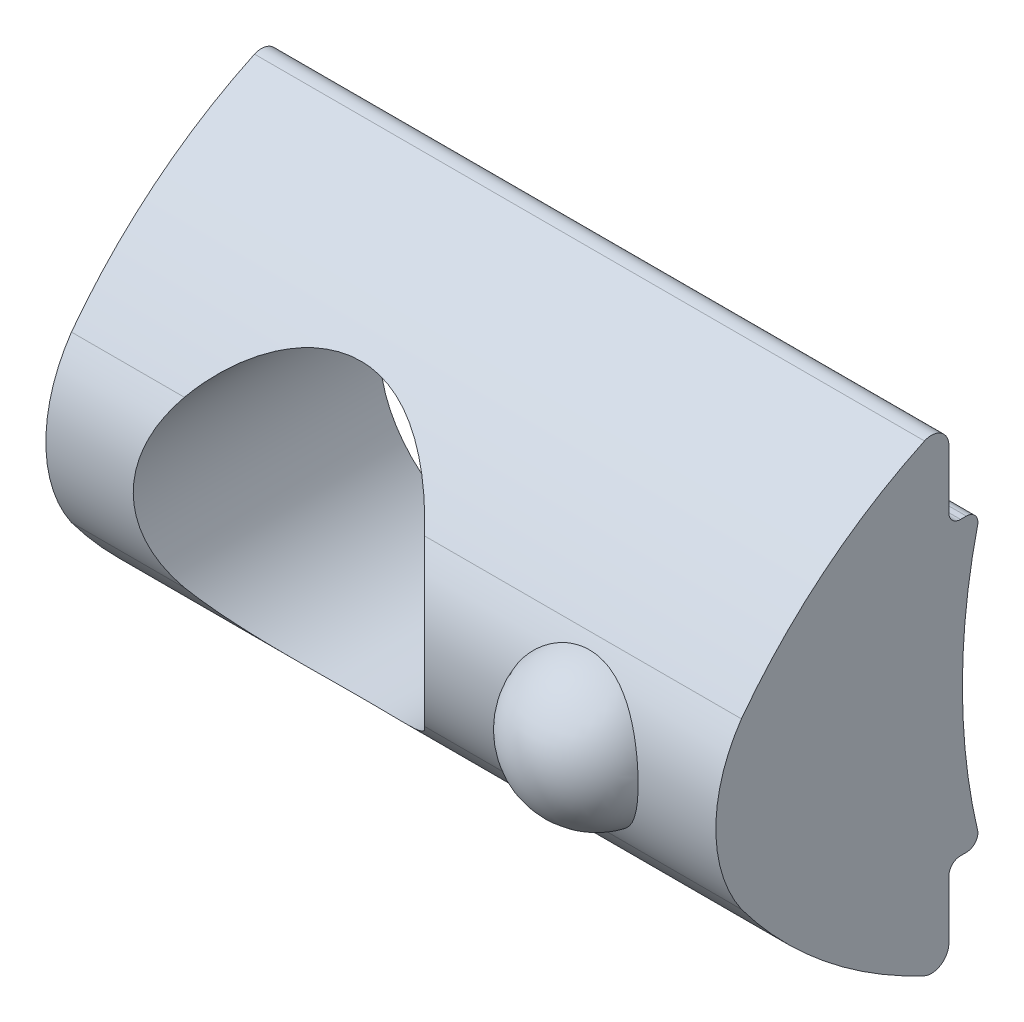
ISO-10303-21;
HEADER;
FILE_DESCRIPTION(('STEP AP214'),'2;1');
FILE_NAME('part.step','',(''),(''),'','','');
FILE_SCHEMA(('AUTOMOTIVE_DESIGN { 1 0 10303 214 1 1 1 1 }'));
ENDSEC;
DATA;
#1=APPLICATION_CONTEXT('core data for automotive mechanical design processes');
#2=APPLICATION_PROTOCOL_DEFINITION('international standard','automotive_design',2000,#1);
#3=PRODUCT_CONTEXT('',#1,'mechanical');
#4=PRODUCT('Part','Part','',(#3));
#5=PRODUCT_RELATED_PRODUCT_CATEGORY('part','',(#4));
#6=PRODUCT_DEFINITION_FORMATION('','',#4);
#7=PRODUCT_DEFINITION_CONTEXT('part definition',#1,'design');
#8=PRODUCT_DEFINITION('design','',#6,#7);
#9=PRODUCT_DEFINITION_SHAPE('','',#8);
#10=(LENGTH_UNIT() NAMED_UNIT(*) SI_UNIT(.MILLI.,.METRE.));
#11=(NAMED_UNIT(*) PLANE_ANGLE_UNIT() SI_UNIT($,.RADIAN.));
#12=(NAMED_UNIT(*) SI_UNIT($,.STERADIAN.) SOLID_ANGLE_UNIT());
#13=UNCERTAINTY_MEASURE_WITH_UNIT(LENGTH_MEASURE(1.E-05),#10,'distance_accuracy_value','');
#14=(GEOMETRIC_REPRESENTATION_CONTEXT(3) GLOBAL_UNCERTAINTY_ASSIGNED_CONTEXT((#13)) GLOBAL_UNIT_ASSIGNED_CONTEXT((#10,
#11,#12)) REPRESENTATION_CONTEXT('',''));
#15=CARTESIAN_POINT('',(0.,0.,0.));
#16=DIRECTION('',(0.,0.,1.));
#17=DIRECTION('',(1.,0.,0.));
#18=AXIS2_PLACEMENT_3D('',#15,#16,#17);
#19=CARTESIAN_POINT('',(-0.00999999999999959,2.70000000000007,-0.199999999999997));
#20=DIRECTION('',(-1.,0.,0.));
#21=DIRECTION('',(0.,1.,0.));
#22=AXIS2_PLACEMENT_3D('',#19,#20,#21);
#23=PLANE('',#22);
#24=DIRECTION('',(0.,0.,1.));
#25=VECTOR('',#24,1.);
#26=CARTESIAN_POINT('',(-0.00999999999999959,2.50100000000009,-0.199999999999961));
#27=LINE('',#26,#25);
#28=CARTESIAN_POINT('',(-0.00999999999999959,2.50100000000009,-0.199999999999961));
#29=VERTEX_POINT('',#28);
#30=CARTESIAN_POINT('',(-0.00999999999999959,2.50100000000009,-0.180025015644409));
#31=VERTEX_POINT('',#30);
#32=EDGE_CURVE('E848',#29,#31,#27,.T.);
#33=ORIENTED_EDGE('',*,*,#32,.F.);
#34=DIRECTION('',(0.,1.,0.));
#35=VECTOR('',#34,1.);
#36=CARTESIAN_POINT('',(-0.0100000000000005,2.49997999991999,-0.199999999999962));
#37=LINE('',#36,#35);
#38=CARTESIAN_POINT('',(-0.0100000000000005,2.50000000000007,-0.199999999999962));
#39=VERTEX_POINT('',#38);
#40=EDGE_CURVE('E857',#39,#29,#37,.T.);
#41=ORIENTED_EDGE('',*,*,#40,.F.);
#42=CARTESIAN_POINT('',(-0.00999999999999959,2.70000000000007,-0.199999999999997));
#43=DIRECTION('',(-1.,0.,0.));
#44=DIRECTION('',(0.,1.,0.));
#45=AXIS2_PLACEMENT_3D('',#42,#43,#44);
#46=CIRCLE('',#45,0.2);
#47=EDGE_CURVE('E437',#39,#31,#46,.T.);
#48=ORIENTED_EDGE('',*,*,#47,.T.);
#49=EDGE_LOOP('',(#33,#41,#48));
#50=FACE_BOUND('',#49,.T.);
#51=ADVANCED_FACE('F14',(#50),#23,.T.);
#52=DIRECTION('',(0.,0.,-1.));
#53=VECTOR('',#52,1.);
#54=CARTESIAN_POINT('',(-0.0100000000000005,-2.50099999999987,-0.199999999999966));
#55=LINE('',#54,#53);
#56=CARTESIAN_POINT('',(-0.0100000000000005,-2.50099999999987,-0.180025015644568));
#57=VERTEX_POINT('',#56);
#58=CARTESIAN_POINT('',(-0.0100000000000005,-2.50099999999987,-0.199999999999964));
#59=VERTEX_POINT('',#58);
#60=EDGE_CURVE('E37',#57,#59,#55,.T.);
#61=ORIENTED_EDGE('',*,*,#60,.F.);
#62=CARTESIAN_POINT('',(-0.00999999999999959,-2.69999999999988,-0.199999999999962));
#63=DIRECTION('',(-1.,0.,0.));
#64=DIRECTION('',(0.,1.,0.));
#65=AXIS2_PLACEMENT_3D('',#62,#63,#64);
#66=CIRCLE('',#65,0.2);
#67=CARTESIAN_POINT('',(-0.0100000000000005,-2.49999999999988,-0.199999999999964));
#68=VERTEX_POINT('',#67);
#69=EDGE_CURVE('E224',#57,#68,#66,.T.);
#70=ORIENTED_EDGE('',*,*,#69,.T.);
#71=DIRECTION('',(0.,1.,0.));
#72=VECTOR('',#71,1.);
#73=CARTESIAN_POINT('',(-0.00999999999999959,-2.75,-0.199999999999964));
#74=LINE('',#73,#72);
#75=EDGE_CURVE('E843',#59,#68,#74,.T.);
#76=ORIENTED_EDGE('',*,*,#75,.F.);
#77=EDGE_LOOP('',(#61,#70,#76));
#78=FACE_BOUND('',#77,.T.);
#79=ADVANCED_FACE('F261',(#78),#23,.T.);
#80=CARTESIAN_POINT('',(0.00999999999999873,2.70000000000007,-0.199999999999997));
#81=DIRECTION('',(1.,0.,0.));
#82=DIRECTION('',(0.,-1.,0.));
#83=AXIS2_PLACEMENT_3D('',#80,#81,#82);
#84=PLANE('',#83);
#85=DIRECTION('',(0.,0.,-1.));
#86=VECTOR('',#85,1.);
#87=CARTESIAN_POINT('',(0.00999999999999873,-2.50099999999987,-0.199999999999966));
#88=LINE('',#87,#86);
#89=CARTESIAN_POINT('',(0.00999999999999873,-2.50099999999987,-0.180025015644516));
#90=VERTEX_POINT('',#89);
#91=CARTESIAN_POINT('',(0.0100000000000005,-2.50099999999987,-0.199999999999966));
#92=VERTEX_POINT('',#91);
#93=EDGE_CURVE('E208',#90,#92,#88,.T.);
#94=ORIENTED_EDGE('',*,*,#93,.T.);
#95=DIRECTION('',(0.,1.,0.));
#96=VECTOR('',#95,1.);
#97=CARTESIAN_POINT('',(0.00999999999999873,2.70000000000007,-0.199999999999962));
#98=LINE('',#97,#96);
#99=CARTESIAN_POINT('',(0.00999999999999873,-2.49999999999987,-0.199999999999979));
#100=VERTEX_POINT('',#99);
#101=EDGE_CURVE('E9',#92,#100,#98,.T.);
#102=ORIENTED_EDGE('',*,*,#101,.T.);
#103=CARTESIAN_POINT('',(0.00999999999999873,-2.69999999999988,-0.199999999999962));
#104=DIRECTION('',(1.,0.,0.));
#105=DIRECTION('',(0.,-1.,0.));
#106=AXIS2_PLACEMENT_3D('',#103,#104,#105);
#107=CIRCLE('',#106,0.2);
#108=EDGE_CURVE('E223',#100,#90,#107,.T.);
#109=ORIENTED_EDGE('',*,*,#108,.T.);
#110=EDGE_LOOP('',(#94,#102,#109));
#111=FACE_BOUND('',#110,.T.);
#112=ADVANCED_FACE('F226',(#111),#84,.T.);
#113=DIRECTION('',(0.,0.,1.));
#114=VECTOR('',#113,1.);
#115=CARTESIAN_POINT('',(0.00999999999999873,2.50100000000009,-0.199999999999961));
#116=LINE('',#115,#114);
#117=CARTESIAN_POINT('',(0.00999999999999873,2.50100000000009,-0.199999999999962));
#118=VERTEX_POINT('',#117);
#119=CARTESIAN_POINT('',(0.0100000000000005,2.50100000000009,-0.180025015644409));
#120=VERTEX_POINT('',#119);
#121=EDGE_CURVE('E29',#118,#120,#116,.T.);
#122=ORIENTED_EDGE('',*,*,#121,.T.);
#123=CARTESIAN_POINT('',(0.00999999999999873,2.70000000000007,-0.199999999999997));
#124=DIRECTION('',(1.,0.,0.));
#125=DIRECTION('',(0.,-1.,0.));
#126=AXIS2_PLACEMENT_3D('',#123,#124,#125);
#127=CIRCLE('',#126,0.2);
#128=CARTESIAN_POINT('',(0.00999999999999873,2.50000000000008,-0.199999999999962));
#129=VERTEX_POINT('',#128);
#130=EDGE_CURVE('E603',#120,#129,#127,.T.);
#131=ORIENTED_EDGE('',*,*,#130,.T.);
#132=DIRECTION('',(0.,-1.,0.));
#133=VECTOR('',#132,1.);
#134=CARTESIAN_POINT('',(0.00999999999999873,2.75,-0.199999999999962));
#135=LINE('',#134,#133);
#136=EDGE_CURVE('E858',#118,#129,#135,.T.);
#137=ORIENTED_EDGE('',*,*,#136,.F.);
#138=EDGE_LOOP('',(#122,#131,#137));
#139=FACE_BOUND('',#138,.T.);
#140=ADVANCED_FACE('F626',(#139),#84,.T.);
#141=CARTESIAN_POINT('',(0.,0.,5.));
#142=DIRECTION('',(0.,0.,-1.));
#143=DIRECTION('',(0.,1.,0.));
#144=AXIS2_PLACEMENT_3D('',#141,#142,#143);
#145=CYLINDRICAL_SURFACE('',#144,2.5);
#146=CARTESIAN_POINT('',(-0.979795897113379,2.29999999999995,-0.499999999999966));
#147=CARTESIAN_POINT('',(-0.948524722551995,2.31332407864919,-0.499966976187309));
#148=CARTESIAN_POINT('',(-0.917012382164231,2.32599228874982,-0.498672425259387));
#149=CARTESIAN_POINT('',(-0.853672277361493,2.34997561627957,-0.494047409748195));
#150=CARTESIAN_POINT('',(-0.821845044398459,2.36129269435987,-0.490719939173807));
#151=CARTESIAN_POINT('',(-0.758312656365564,2.38245073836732,-0.482559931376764));
#152=CARTESIAN_POINT('',(-0.726610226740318,2.39230702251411,-0.477744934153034));
#153=CARTESIAN_POINT('',(-0.663018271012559,2.41070584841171,-0.466908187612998));
#154=CARTESIAN_POINT('',(-0.631128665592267,2.41924778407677,-0.460885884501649));
#155=CARTESIAN_POINT('',(-0.55083112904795,2.43907045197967,-0.444563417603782));
#156=CARTESIAN_POINT('',(-0.502338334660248,2.44950944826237,-0.433653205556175));
#157=CARTESIAN_POINT('',(-0.405160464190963,2.46744549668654,-0.410354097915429));
#158=CARTESIAN_POINT('',(-0.356475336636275,2.4749416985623,-0.397964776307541));
#159=CARTESIAN_POINT('',(-0.258167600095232,2.48713597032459,-0.372034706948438));
#160=CARTESIAN_POINT('',(-0.208543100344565,2.49178440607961,-0.35847798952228));
#161=CARTESIAN_POINT('',(-0.109278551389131,2.49810431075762,-0.330890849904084));
#162=CARTESIAN_POINT('',(-0.0596385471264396,2.49977818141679,-0.316860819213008));
#163=CARTESIAN_POINT('',(-0.00999999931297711,2.49997999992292,-0.302828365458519));
#164=B_SPLINE_CURVE_WITH_KNOTS('',3,(#146,#147,#148,#149,#150,#151,#152,#153,#154,#155,#156,
#157,#158,#159,#160,#161,#162,#163),.UNSPECIFIED.,.F.,.F.,(4,2,2,2,2,2,2,2,4),(0.,
0.101894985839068,0.203640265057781,0.304228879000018,0.404863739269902,0.557103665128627,
0.709387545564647,0.864255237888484,1.01899782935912),.UNSPECIFIED.);
#165=CARTESIAN_POINT('',(-0.979795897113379,2.29999999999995,-0.499999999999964));
#166=VERTEX_POINT('',#165);
#167=CARTESIAN_POINT('',(-0.0100000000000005,2.49997999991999,-0.302828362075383));
#168=VERTEX_POINT('',#167);
#169=EDGE_CURVE('E22',#166,#168,#164,.T.);
#170=ORIENTED_EDGE('',*,*,#169,.T.);
#171=DIRECTION('',(0.,0.,-1.));
#172=VECTOR('',#171,1.);
#173=CARTESIAN_POINT('',(-0.0100000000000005,2.49997999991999,-0.199999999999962));
#174=LINE('',#173,#172);
#175=CARTESIAN_POINT('',(-0.0100000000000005,2.49997999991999,-0.199999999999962));
#176=VERTEX_POINT('',#175);
#177=EDGE_CURVE('E606',#176,#168,#174,.T.);
#178=ORIENTED_EDGE('',*,*,#177,.F.);
#179=CARTESIAN_POINT('',(0.,0.,-0.199999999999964));
#180=DIRECTION('',(0.,0.,1.));
#181=DIRECTION('',(0.,1.,0.));
#182=AXIS2_PLACEMENT_3D('',#179,#180,#181);
#183=CIRCLE('',#182,2.5);
#184=CARTESIAN_POINT('',(0.00999999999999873,2.49997999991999,-0.199999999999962));
#185=VERTEX_POINT('',#184);
#186=EDGE_CURVE('E861',#185,#176,#183,.T.);
#187=ORIENTED_EDGE('',*,*,#186,.F.);
#188=DIRECTION('',(0.,0.,-1.));
#189=VECTOR('',#188,1.);
#190=CARTESIAN_POINT('',(0.00999999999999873,2.49997999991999,-0.199999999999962));
#191=LINE('',#190,#189);
#192=CARTESIAN_POINT('',(0.00999999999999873,2.49997999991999,-0.302828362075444));
#193=VERTEX_POINT('',#192);
#194=EDGE_CURVE('E864',#185,#193,#191,.T.);
#195=ORIENTED_EDGE('',*,*,#194,.T.);
#196=CARTESIAN_POINT('',(0.00999999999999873,2.49997999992,-0.30282836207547));
#197=CARTESIAN_POINT('',(0.0747007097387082,2.49971254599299,-0.321101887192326));
#198=CARTESIAN_POINT('',(0.139414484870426,2.49695004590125,-0.339399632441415));
#199=CARTESIAN_POINT('',(0.268088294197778,2.48641645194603,-0.37474994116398));
#200=CARTESIAN_POINT('',(0.332049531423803,2.47869439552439,-0.391812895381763));
#201=CARTESIAN_POINT('',(0.444802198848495,2.46061031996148,-0.420065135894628));
#202=CARTESIAN_POINT('',(0.493648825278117,2.45128560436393,-0.431695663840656));
#203=CARTESIAN_POINT('',(0.591067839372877,2.42963539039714,-0.45305579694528));
#204=CARTESIAN_POINT('',(0.639640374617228,2.41731170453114,-0.462786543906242));
#205=CARTESIAN_POINT('',(0.73718090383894,2.38938817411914,-0.479668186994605));
#206=CARTESIAN_POINT('',(0.786142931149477,2.37373941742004,-0.486775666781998));
#207=CARTESIAN_POINT('',(0.859133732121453,2.34788376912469,-0.494391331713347));
#208=CARTESIAN_POINT('',(0.883422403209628,2.33885377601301,-0.496422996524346));
#209=CARTESIAN_POINT('',(0.931787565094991,2.32001011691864,-0.499222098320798));
#210=CARTESIAN_POINT('',(0.955863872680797,2.31019583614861,-0.499988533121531));
#211=CARTESIAN_POINT('',(0.979795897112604,2.30000000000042,-0.500000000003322));
#212=B_SPLINE_CURVE_WITH_KNOTS('',3,(#196,#197,#198,#199,#200,#201,#202,#203,#204,#205,#206,
#207,#208,#209,#210,#211),.UNSPECIFIED.,.F.,.F.,(4,2,2,2,2,2,2,4),(0.,0.201700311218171,
0.401436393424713,0.554538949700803,0.707549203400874,0.86298896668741,0.940927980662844,
1.01892870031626),.UNSPECIFIED.);
#213=CARTESIAN_POINT('',(0.97979589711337,2.29999999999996,-0.499999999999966));
#214=VERTEX_POINT('',#213);
#215=EDGE_CURVE('E228',#193,#214,#212,.T.);
#216=ORIENTED_EDGE('',*,*,#215,.T.);
#217=CARTESIAN_POINT('',(0.979795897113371,2.29999999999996,-0.499999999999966));
#218=CARTESIAN_POINT('',(1.04493272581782,2.27225092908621,-0.493444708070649));
#219=CARTESIAN_POINT('',(1.10881088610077,2.24176888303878,-0.48636318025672));
#220=CARTESIAN_POINT('',(1.23367257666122,2.17555736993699,-0.471367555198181));
#221=CARTESIAN_POINT('',(1.29465655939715,2.13982872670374,-0.463453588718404));
#222=CARTESIAN_POINT('',(1.47255444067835,2.02520036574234,-0.43881393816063));
#223=CARTESIAN_POINT('',(1.58461084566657,1.93877410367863,-0.421169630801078));
#224=CARTESIAN_POINT('',(1.7924952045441,1.74838669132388,-0.385459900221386));
#225=CARTESIAN_POINT('',(1.88832243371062,1.64442475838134,-0.367394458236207));
#226=CARTESIAN_POINT('',(2.06122918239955,1.42168711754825,-0.332841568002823));
#227=CARTESIAN_POINT('',(2.13831105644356,1.30291327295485,-0.316353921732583));
#228=CARTESIAN_POINT('',(2.27162782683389,1.05344814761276,-0.286754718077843));
#229=CARTESIAN_POINT('',(2.32781637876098,0.92273116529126,-0.273650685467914));
#230=CARTESIAN_POINT('',(2.4173021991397,0.653292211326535,-0.252354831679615));
#231=CARTESIAN_POINT('',(2.45060165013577,0.514571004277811,-0.244162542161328));
#232=CARTESIAN_POINT('',(2.49262059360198,0.236805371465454,-0.233768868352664));
#233=CARTESIAN_POINT('',(2.50193598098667,0.0978564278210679,-0.231422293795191));
#234=CARTESIAN_POINT('',(2.49739531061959,-0.179628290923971,-0.232557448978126));
#235=CARTESIAN_POINT('',(2.48354170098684,-0.318164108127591,-0.236038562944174));
#236=CARTESIAN_POINT('',(2.4335518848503,-0.588585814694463,-0.24833936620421));
#237=CARTESIAN_POINT('',(2.39777647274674,-0.720542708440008,-0.257072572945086));
#238=CARTESIAN_POINT('',(2.3053983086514,-0.976556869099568,-0.278873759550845));
#239=CARTESIAN_POINT('',(2.24879477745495,-1.10061384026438,-0.291941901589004));
#240=CARTESIAN_POINT('',(2.11529962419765,-1.33960850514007,-0.321295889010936));
#241=CARTESIAN_POINT('',(2.03808637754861,-1.45436031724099,-0.337631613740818));
#242=CARTESIAN_POINT('',(1.86596158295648,-1.66948499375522,-0.371647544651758));
#243=CARTESIAN_POINT('',(1.77104708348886,-1.7698554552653,-0.389327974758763));
#244=CARTESIAN_POINT('',(1.5668567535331,-1.95283176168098,-0.423998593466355));
#245=CARTESIAN_POINT('',(1.45772430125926,-2.03559572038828,-0.440993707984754));
#246=CARTESIAN_POINT('',(1.28490556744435,-2.14562427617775,-0.4647311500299));
#247=CARTESIAN_POINT('',(1.22573823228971,-2.17996513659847,-0.47235543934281));
#248=CARTESIAN_POINT('',(1.10470544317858,-2.24372475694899,-0.486817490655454));
#249=CARTESIAN_POINT('',(1.04283958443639,-2.27314277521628,-0.493655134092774));
#250=CARTESIAN_POINT('',(0.979795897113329,-2.29999999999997,-0.499999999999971));
#251=B_SPLINE_CURVE_WITH_KNOTS('',3,(#217,#218,#219,#220,#221,#222,#223,#224,#225,#226,#227,
#228,#229,#230,#231,#232,#233,#234,#235,#236,#237,#238,#239,#240,#241,#242,#243,#244,#245,#246,
#247,#248,#249,#250),.UNSPECIFIED.,.F.,.F.,(4,2,2,2,2,2,2,2,2,2,2,2,2,2,2,2,4),(0.,
0.213173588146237,0.426313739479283,0.851957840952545,1.2776209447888,1.70323055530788,
2.12977867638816,2.55628611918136,2.97208977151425,3.38784949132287,3.79694376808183,
4.20605335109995,4.62196393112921,5.03794392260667,5.4500138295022,5.65631488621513,
5.86264699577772),.UNSPECIFIED.);
#252=CARTESIAN_POINT('',(0.97979589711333,-2.29999999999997,-0.499999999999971));
#253=VERTEX_POINT('',#252);
#254=EDGE_CURVE('E232',#214,#253,#251,.T.);
#255=ORIENTED_EDGE('',*,*,#254,.T.);
#256=CARTESIAN_POINT('',(0.97979589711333,-2.29999999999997,-0.499999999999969));
#257=CARTESIAN_POINT('',(0.948524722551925,-2.31332407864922,-0.499966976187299));
#258=CARTESIAN_POINT('',(0.91701238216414,-2.32599228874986,-0.498672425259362));
#259=CARTESIAN_POINT('',(0.853672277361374,-2.34997561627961,-0.494047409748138));
#260=CARTESIAN_POINT('',(0.821845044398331,-2.36129269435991,-0.490719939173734));
#261=CARTESIAN_POINT('',(0.758312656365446,-2.38245073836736,-0.482559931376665));
#262=CARTESIAN_POINT('',(0.726610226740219,-2.39230702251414,-0.477744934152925));
#263=CARTESIAN_POINT('',(0.663018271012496,-2.41070584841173,-0.466908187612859));
#264=CARTESIAN_POINT('',(0.63112866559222,-2.41924778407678,-0.46088588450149));
#265=CARTESIAN_POINT('',(0.550831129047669,-2.43907045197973,-0.444563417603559));
#266=CARTESIAN_POINT('',(0.502338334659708,-2.44950944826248,-0.43365320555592));
#267=CARTESIAN_POINT('',(0.40516046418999,-2.4674454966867,-0.410354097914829));
#268=CARTESIAN_POINT('',(0.356475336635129,-2.47494169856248,-0.397964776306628));
#269=CARTESIAN_POINT('',(0.2581676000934,-2.48713597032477,-0.372034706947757));
#270=CARTESIAN_POINT('',(0.208543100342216,-2.49178440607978,-0.358477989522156));
#271=CARTESIAN_POINT('',(0.109278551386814,-2.49810431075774,-0.330890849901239));
#272=CARTESIAN_POINT('',(0.0596385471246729,-2.49977818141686,-0.316860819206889));
#273=CARTESIAN_POINT('',(0.00999999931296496,-2.49997999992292,-0.302828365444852));
#274=B_SPLINE_CURVE_WITH_KNOTS('',3,(#256,#257,#258,#259,#260,#261,#262,#263,#264,#265,#266,
#267,#268,#269,#270,#271,#272,#273),.UNSPECIFIED.,.F.,.F.,(4,2,2,2,2,2,2,2,4),(0.,
0.101894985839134,0.203640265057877,0.304228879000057,0.404863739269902,0.557103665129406,
0.709387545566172,0.864255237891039,1.01899782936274),.UNSPECIFIED.);
#275=CARTESIAN_POINT('',(0.00999999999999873,-2.49997999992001,-0.302828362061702));
#276=VERTEX_POINT('',#275);
#277=EDGE_CURVE('E443',#253,#276,#274,.T.);
#278=ORIENTED_EDGE('',*,*,#277,.T.);
#279=DIRECTION('',(0.,0.,-1.));
#280=VECTOR('',#279,1.);
#281=CARTESIAN_POINT('',(0.00999999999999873,-2.49997999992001,-0.199999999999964));
#282=LINE('',#281,#280);
#283=CARTESIAN_POINT('',(0.00999999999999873,-2.49997999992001,-0.199999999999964));
#284=VERTEX_POINT('',#283);
#285=EDGE_CURVE('E614',#284,#276,#282,.T.);
#286=ORIENTED_EDGE('',*,*,#285,.F.);
#287=CARTESIAN_POINT('',(0.,0.,-0.199999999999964));
#288=DIRECTION('',(0.,0.,1.));
#289=DIRECTION('',(0.,1.,0.));
#290=AXIS2_PLACEMENT_3D('',#287,#288,#289);
#291=CIRCLE('',#290,2.5);
#292=CARTESIAN_POINT('',(-0.0100000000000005,-2.49997999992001,-0.199999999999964));
#293=VERTEX_POINT('',#292);
#294=EDGE_CURVE('E216',#293,#284,#291,.T.);
#295=ORIENTED_EDGE('',*,*,#294,.F.);
#296=DIRECTION('',(0.,0.,-1.));
#297=VECTOR('',#296,1.);
#298=CARTESIAN_POINT('',(-0.0100000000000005,-2.49997999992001,-0.199999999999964));
#299=LINE('',#298,#297);
#300=CARTESIAN_POINT('',(-0.0100000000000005,-2.49997999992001,-0.302828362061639));
#301=VERTEX_POINT('',#300);
#302=EDGE_CURVE('E567',#293,#301,#299,.T.);
#303=ORIENTED_EDGE('',*,*,#302,.T.);
#304=CARTESIAN_POINT('',(-0.00999999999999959,-2.49997999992,-0.302828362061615));
#305=CARTESIAN_POINT('',(-0.0747007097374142,-2.49971254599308,-0.321101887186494));
#306=CARTESIAN_POINT('',(-0.139414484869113,-2.49695004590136,-0.339399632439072));
#307=CARTESIAN_POINT('',(-0.26808829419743,-2.48641645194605,-0.374749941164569));
#308=CARTESIAN_POINT('',(-0.332049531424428,-2.47869439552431,-0.391812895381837));
#309=CARTESIAN_POINT('',(-0.444802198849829,-2.46061031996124,-0.420065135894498));
#310=CARTESIAN_POINT('',(-0.493648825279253,-2.45128560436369,-0.431695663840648));
#311=CARTESIAN_POINT('',(-0.59106783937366,-2.42963539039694,-0.453055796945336));
#312=CARTESIAN_POINT('',(-0.639640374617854,-2.41731170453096,-0.462786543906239));
#313=CARTESIAN_POINT('',(-0.737180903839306,-2.38938817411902,-0.479668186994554));
#314=CARTESIAN_POINT('',(-0.786142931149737,-2.37373941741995,-0.486775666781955));
#315=CARTESIAN_POINT('',(-0.859133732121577,-2.34788376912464,-0.494391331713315));
#316=CARTESIAN_POINT('',(-0.883422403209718,-2.33885377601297,-0.496422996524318));
#317=CARTESIAN_POINT('',(-0.931787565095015,-2.32001011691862,-0.499222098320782));
#318=CARTESIAN_POINT('',(-0.955863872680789,-2.3101958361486,-0.499988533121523));
#319=CARTESIAN_POINT('',(-0.979795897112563,-2.30000000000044,-0.500000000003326));
#320=B_SPLINE_CURVE_WITH_KNOTS('',3,(#304,#305,#306,#307,#308,#309,#310,#311,#312,#313,#314,
#315,#316,#317,#318,#319),.UNSPECIFIED.,.F.,.F.,(4,2,2,2,2,2,2,4),(0.,0.201700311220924,
0.401436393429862,0.554538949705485,0.707549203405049,0.862988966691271,0.9409279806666,
1.01892870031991),.UNSPECIFIED.);
#321=CARTESIAN_POINT('',(-0.97979589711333,-2.29999999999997,-0.499999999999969));
#322=VERTEX_POINT('',#321);
#323=EDGE_CURVE('E280',#301,#322,#320,.T.);
#324=ORIENTED_EDGE('',*,*,#323,.T.);
#325=CARTESIAN_POINT('',(-0.979795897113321,-2.3,-0.499999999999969));
#326=CARTESIAN_POINT('',(-1.04493272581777,-2.27225092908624,-0.493444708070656));
#327=CARTESIAN_POINT('',(-1.10881088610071,-2.24176888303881,-0.486363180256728));
#328=CARTESIAN_POINT('',(-1.23367257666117,-2.17555736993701,-0.471367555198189));
#329=CARTESIAN_POINT('',(-1.2946565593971,-2.13982872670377,-0.463453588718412));
#330=CARTESIAN_POINT('',(-1.47255444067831,-2.02520036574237,-0.438813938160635));
#331=CARTESIAN_POINT('',(-1.58461084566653,-1.93877410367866,-0.421169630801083));
#332=CARTESIAN_POINT('',(-1.79249520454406,-1.74838669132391,-0.385459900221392));
#333=CARTESIAN_POINT('',(-1.88832243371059,-1.64442475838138,-0.367394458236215));
#334=CARTESIAN_POINT('',(-2.06122918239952,-1.42168711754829,-0.33284156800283));
#335=CARTESIAN_POINT('',(-2.13831105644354,-1.3029132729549,-0.316353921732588));
#336=CARTESIAN_POINT('',(-2.27162782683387,-1.05344814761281,-0.286754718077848));
#337=CARTESIAN_POINT('',(-2.32781637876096,-0.922731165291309,-0.27365068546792));
#338=CARTESIAN_POINT('',(-2.41730219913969,-0.653292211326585,-0.252354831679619));
#339=CARTESIAN_POINT('',(-2.45060165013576,-0.514571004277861,-0.24416254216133));
#340=CARTESIAN_POINT('',(-2.49262059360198,-0.236805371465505,-0.233768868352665));
#341=CARTESIAN_POINT('',(-2.50193598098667,-0.0978564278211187,-0.231422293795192));
#342=CARTESIAN_POINT('',(-2.49739531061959,0.17962829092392,-0.232557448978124));
#343=CARTESIAN_POINT('',(-2.48354170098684,0.31816410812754,-0.236038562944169));
#344=CARTESIAN_POINT('',(-2.43355188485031,0.588585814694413,-0.248339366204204));
#345=CARTESIAN_POINT('',(-2.39777647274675,0.720542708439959,-0.257072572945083));
#346=CARTESIAN_POINT('',(-2.30539830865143,0.97655686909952,-0.27887375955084));
#347=CARTESIAN_POINT('',(-2.24879477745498,1.10061384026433,-0.291941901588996));
#348=CARTESIAN_POINT('',(-2.11529962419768,1.33960850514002,-0.321295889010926));
#349=CARTESIAN_POINT('',(-2.03808637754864,1.45436031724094,-0.33763161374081));
#350=CARTESIAN_POINT('',(-1.86596158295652,1.66948499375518,-0.371647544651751));
#351=CARTESIAN_POINT('',(-1.77104708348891,1.76985545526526,-0.389327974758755));
#352=CARTESIAN_POINT('',(-1.56685675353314,1.95283176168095,-0.423998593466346));
#353=CARTESIAN_POINT('',(-1.45772430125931,2.03559572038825,-0.440993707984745));
#354=CARTESIAN_POINT('',(-1.2849055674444,2.14562427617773,-0.464731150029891));
#355=CARTESIAN_POINT('',(-1.22573823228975,2.17996513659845,-0.472355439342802));
#356=CARTESIAN_POINT('',(-1.10470544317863,2.24372475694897,-0.486817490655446));
#357=CARTESIAN_POINT('',(-1.04283958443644,2.27314277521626,-0.493655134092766));
#358=CARTESIAN_POINT('',(-0.979795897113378,2.29999999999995,-0.499999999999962));
#359=B_SPLINE_CURVE_WITH_KNOTS('',3,(#325,#326,#327,#328,#329,#330,#331,#332,#333,#334,#335,
#336,#337,#338,#339,#340,#341,#342,#343,#344,#345,#346,#347,#348,#349,#350,#351,#352,#353,#354,
#355,#356,#357,#358),.UNSPECIFIED.,.F.,.F.,(4,2,2,2,2,2,2,2,2,2,2,2,2,2,2,2,4),(0.,
0.213173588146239,0.426313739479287,0.851957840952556,1.2776209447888,1.70323055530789,
2.12977867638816,2.55628611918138,2.97208977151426,3.38784949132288,3.79694376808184,
4.20605335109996,4.62196393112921,5.03794392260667,5.45001382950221,5.65631488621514,
5.86264699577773),.UNSPECIFIED.);
#360=EDGE_CURVE('E273',#322,#166,#359,.T.);
#361=ORIENTED_EDGE('',*,*,#360,.T.);
#362=EDGE_LOOP('',(#170,#178,#187,#195,#216,#255,#278,#286,#295,#303,#324,#361));
#363=FACE_BOUND('',#362,.T.);
#364=CARTESIAN_POINT('',(2.06063779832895,1.41554648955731,3.56063779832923));
#365=CARTESIAN_POINT('',(2.01810144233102,1.47744428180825,3.51437476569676));
#366=CARTESIAN_POINT('',(1.97277548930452,1.53747068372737,3.46815112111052));
#367=CARTESIAN_POINT('',(1.87654582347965,1.65356762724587,3.37633113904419));
#368=CARTESIAN_POINT('',(1.82563492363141,1.70963291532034,3.33073569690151));
#369=CARTESIAN_POINT('',(1.71776298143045,1.81801954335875,3.24035423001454));
#370=CARTESIAN_POINT('',(1.66074202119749,1.87029339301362,3.19558245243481));
#371=CARTESIAN_POINT('',(1.5411681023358,1.96998935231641,3.10818711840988));
#372=CARTESIAN_POINT('',(1.47861844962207,2.01741432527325,3.0655623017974));
#373=CARTESIAN_POINT('',(1.31807743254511,2.12743838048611,2.96456929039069));
#374=CARTESIAN_POINT('',(1.21693650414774,2.18708831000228,2.90789127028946));
#375=CARTESIAN_POINT('',(1.00336541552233,2.29289604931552,2.80489927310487));
#376=CARTESIAN_POINT('',(0.890981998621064,2.33910683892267,2.75854477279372));
#377=CARTESIAN_POINT('',(0.679637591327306,2.40786838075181,2.68843473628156));
#378=CARTESIAN_POINT('',(0.582519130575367,2.43330784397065,2.66200957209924));
#379=CARTESIAN_POINT('',(0.383492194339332,2.47248690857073,2.62100919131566));
#380=CARTESIAN_POINT('',(0.281586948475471,2.4862342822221,2.60642610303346));
#381=CARTESIAN_POINT('',(0.0753430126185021,2.50100955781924,2.59074414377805));
#382=CARTESIAN_POINT('',(-0.0290042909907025,2.50198223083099,2.5897038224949));
#383=CARTESIAN_POINT('',(-0.236230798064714,2.49097784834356,2.60139546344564));
#384=CARTESIAN_POINT('',(-0.339109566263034,2.47899703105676,2.61413142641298));
#385=CARTESIAN_POINT('',(-0.534174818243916,2.444153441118,2.65069634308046));
#386=CARTESIAN_POINT('',(-0.626630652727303,2.4219994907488,2.67380078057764));
#387=CARTESIAN_POINT('',(-0.805997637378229,2.36836335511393,2.72882696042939));
#388=CARTESIAN_POINT('',(-0.892906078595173,2.33687665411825,2.76075297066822));
#389=CARTESIAN_POINT('',(-1.10464214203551,2.24702060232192,2.85003242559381));
#390=CARTESIAN_POINT('',(-1.22526298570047,2.18323513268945,2.91191118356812));
#391=CARTESIAN_POINT('',(-1.45115730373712,2.04012547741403,3.04542149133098));
#392=CARTESIAN_POINT('',(-1.55638000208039,1.96075181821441,3.11708386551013));
#393=CARTESIAN_POINT('',(-1.73194971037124,1.80588388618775,3.25088610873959));
#394=CARTESIAN_POINT('',(-1.80508165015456,1.73271404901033,3.31211512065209));
#395=CARTESIAN_POINT('',(-1.94065351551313,1.5793049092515,3.43577396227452));
#396=CARTESIAN_POINT('',(-2.00317069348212,1.49912374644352,3.49819108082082));
#397=CARTESIAN_POINT('',(-2.06063779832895,1.41554648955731,3.56063779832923));
#398=B_SPLINE_CURVE_WITH_KNOTS('',3,(#364,#365,#366,#367,#368,#369,#370,#371,#372,#373,#374,
#375,#376,#377,#378,#379,#380,#381,#382,#383,#384,#385,#386,#387,#388,#389,#390,#391,#392,#393,
#394,#395,#396,#397),.UNSPECIFIED.,.F.,.F.,(4,2,2,2,2,2,2,2,2,2,2,2,2,2,2,2,4),(0.,
0.26458118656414,0.529506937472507,0.797321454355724,1.06497689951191,1.45475171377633,
1.84296845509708,2.15315320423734,2.46313159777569,2.77444968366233,3.08585820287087,
3.37825964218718,3.67080279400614,4.11780559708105,4.56625071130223,4.92621699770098,
5.28343937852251),.UNSPECIFIED.);
#399=CARTESIAN_POINT('',(2.06063779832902,1.41554648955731,3.56063779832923));
#400=VERTEX_POINT('',#399);
#401=CARTESIAN_POINT('',(-2.06063779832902,1.41554648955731,3.56063779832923));
#402=VERTEX_POINT('',#401);
#403=EDGE_CURVE('E294',#400,#402,#398,.T.);
#404=ORIENTED_EDGE('',*,*,#403,.T.);
#405=CARTESIAN_POINT('',(0.,0.,1.5000000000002));
#406=DIRECTION('',(-0.707106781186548,0.,-0.707106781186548));
#407=DIRECTION('',(0.707106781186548,0.,-0.707106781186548));
#408=AXIS2_PLACEMENT_3D('',#405,#406,#407);
#409=ELLIPSE('',#408,3.53553390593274,2.5);
#410=CARTESIAN_POINT('',(-2.06063779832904,-1.41554648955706,3.56063779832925));
#411=VERTEX_POINT('',#410);
#412=EDGE_CURVE('E287',#402,#411,#409,.F.);
#413=ORIENTED_EDGE('',*,*,#412,.T.);
#414=CARTESIAN_POINT('',(-2.06063779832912,-1.41554648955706,3.56063779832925));
#415=CARTESIAN_POINT('',(-2.01810144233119,-1.47744428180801,3.51437476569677));
#416=CARTESIAN_POINT('',(-1.9727754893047,-1.53747068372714,3.46815112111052));
#417=CARTESIAN_POINT('',(-1.87654582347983,-1.65356762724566,3.37633113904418));
#418=CARTESIAN_POINT('',(-1.82563492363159,-1.70963291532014,3.3307356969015));
#419=CARTESIAN_POINT('',(-1.71776298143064,-1.81801954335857,3.24035423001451));
#420=CARTESIAN_POINT('',(-1.66074202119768,-1.87029339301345,3.19558245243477));
#421=CARTESIAN_POINT('',(-1.54116810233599,-1.96998935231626,3.10818711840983));
#422=CARTESIAN_POINT('',(-1.47861844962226,-2.0174143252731,3.06556230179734));
#423=CARTESIAN_POINT('',(-1.3180774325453,-2.12743838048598,2.96456929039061));
#424=CARTESIAN_POINT('',(-1.21693650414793,-2.18708831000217,2.90789127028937));
#425=CARTESIAN_POINT('',(-1.00336541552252,-2.29289604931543,2.80489927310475));
#426=CARTESIAN_POINT('',(-0.890981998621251,-2.3391068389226,2.75854477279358));
#427=CARTESIAN_POINT('',(-0.679637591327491,-2.40786838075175,2.6884347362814));
#428=CARTESIAN_POINT('',(-0.582519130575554,-2.43330784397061,2.66200957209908));
#429=CARTESIAN_POINT('',(-0.38349219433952,-2.4724869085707,2.62100919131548));
#430=CARTESIAN_POINT('',(-0.281586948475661,-2.48623428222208,2.60642610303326));
#431=CARTESIAN_POINT('',(-0.0753430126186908,-2.50100955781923,2.59074414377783));
#432=CARTESIAN_POINT('',(0.0290042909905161,-2.50198223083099,2.58970382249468));
#433=CARTESIAN_POINT('',(0.236230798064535,-2.49097784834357,2.60139546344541));
#434=CARTESIAN_POINT('',(0.339109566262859,-2.47899703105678,2.61413142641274));
#435=CARTESIAN_POINT('',(0.534174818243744,-2.44415344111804,2.65069634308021));
#436=CARTESIAN_POINT('',(0.626630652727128,-2.42199949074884,2.67380078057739));
#437=CARTESIAN_POINT('',(0.805997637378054,-2.36836335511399,2.72882696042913));
#438=CARTESIAN_POINT('',(0.892906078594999,-2.33687665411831,2.76075297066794));
#439=CARTESIAN_POINT('',(1.10464214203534,-2.247020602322,2.85003242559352));
#440=CARTESIAN_POINT('',(1.22526298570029,-2.18323513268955,2.91191118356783));
#441=CARTESIAN_POINT('',(1.45115730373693,-2.04012547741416,3.04542149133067));
#442=CARTESIAN_POINT('',(1.55638000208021,-1.96075181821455,3.11708386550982));
#443=CARTESIAN_POINT('',(1.73194971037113,-1.80588388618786,3.25088610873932));
#444=CARTESIAN_POINT('',(1.80508165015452,-1.73271404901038,3.31211512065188));
#445=CARTESIAN_POINT('',(1.94065351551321,-1.57930490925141,3.43577396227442));
#446=CARTESIAN_POINT('',(2.00317069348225,-1.49912374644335,3.49819108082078));
#447=CARTESIAN_POINT('',(2.06063779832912,-1.41554648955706,3.56063779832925));
#448=B_SPLINE_CURVE_WITH_KNOTS('',3,(#414,#415,#416,#417,#418,#419,#420,#421,#422,#423,#424,
#425,#426,#427,#428,#429,#430,#431,#432,#433,#434,#435,#436,#437,#438,#439,#440,#441,#442,#443,
#444,#445,#446,#447),.UNSPECIFIED.,.F.,.F.,(4,2,2,2,2,2,2,2,2,2,2,2,2,2,2,2,4),(0.,
0.264581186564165,0.529506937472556,0.797321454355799,1.06497689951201,1.45475171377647,
1.84296845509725,2.15315320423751,2.46313159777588,2.77444968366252,3.08585820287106,
3.37825964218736,3.67080279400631,4.11780559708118,4.56625071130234,4.92621699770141,
5.28343937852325),.UNSPECIFIED.);
#449=CARTESIAN_POINT('',(2.06063779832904,-1.41554648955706,3.56063779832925));
#450=VERTEX_POINT('',#449);
#451=EDGE_CURVE('E301',#411,#450,#448,.T.);
#452=ORIENTED_EDGE('',*,*,#451,.T.);
#453=CARTESIAN_POINT('',(0.,0.,1.5000000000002));
#454=DIRECTION('',(0.707106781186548,0.,-0.707106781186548));
#455=DIRECTION('',(-0.707106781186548,0.,-0.707106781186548));
#456=AXIS2_PLACEMENT_3D('',#453,#454,#455);
#457=ELLIPSE('',#456,3.53553390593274,2.5);
#458=EDGE_CURVE('E302',#450,#400,#457,.F.);
#459=ORIENTED_EDGE('',*,*,#458,.T.);
#460=EDGE_LOOP('',(#404,#413,#452,#459));
#461=FACE_BOUND('',#460,.T.);
#462=ADVANCED_FACE('F251',(#363,#461),#145,.F.);
#463=CARTESIAN_POINT('',(7.5,-2.49999999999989,-0.299999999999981));
#464=DIRECTION('',(0.,1.,-1.45512983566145E-13));
#465=DIRECTION('',(0.,1.45512983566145E-13,1.));
#466=AXIS2_PLACEMENT_3D('',#463,#464,#465);
#467=PLANE('',#466);
#468=DIRECTION('',(-1.,0.,0.));
#469=VECTOR('',#468,1.);
#470=CARTESIAN_POINT('',(7.5,-2.49999999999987,-0.199999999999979));
#471=LINE('',#470,#469);
#472=CARTESIAN_POINT('',(7.5,-2.49999999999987,-0.199999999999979));
#473=VERTEX_POINT('',#472);
#474=EDGE_CURVE('E339',#473,#100,#471,.T.);
#475=ORIENTED_EDGE('',*,*,#474,.T.);
#476=DIRECTION('',(0.,1.45512983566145E-13,1.));
#477=VECTOR('',#476,1.);
#478=CARTESIAN_POINT('',(0.00999999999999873,-2.49999999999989,-0.299999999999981));
#479=LINE('',#478,#477);
#480=CARTESIAN_POINT('',(0.00999999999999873,-2.49999999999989,-0.299999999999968));
#481=VERTEX_POINT('',#480);
#482=EDGE_CURVE('E229',#481,#100,#479,.T.);
#483=ORIENTED_EDGE('',*,*,#482,.F.);
#484=DIRECTION('',(-1.,0.,0.));
#485=VECTOR('',#484,1.);
#486=CARTESIAN_POINT('',(7.5,-2.49999999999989,-0.299999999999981));
#487=LINE('',#486,#485);
#488=CARTESIAN_POINT('',(7.5,-2.49999999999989,-0.299999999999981));
#489=VERTEX_POINT('',#488);
#490=EDGE_CURVE('E345',#489,#481,#487,.T.);
#491=ORIENTED_EDGE('',*,*,#490,.F.);
#492=DIRECTION('',(0.,-1.45512983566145E-13,-1.));
#493=VECTOR('',#492,1.);
#494=CARTESIAN_POINT('',(7.5,-2.49999999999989,-0.299999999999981));
#495=LINE('',#494,#493);
#496=EDGE_CURVE('E462',#473,#489,#495,.T.);
#497=ORIENTED_EDGE('',*,*,#496,.F.);
#498=EDGE_LOOP('',(#475,#483,#491,#497));
#499=FACE_BOUND('',#498,.T.);
#500=ADVANCED_FACE('F619',(#499),#467,.F.);
#501=CARTESIAN_POINT('',(7.5,-2.29999999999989,-0.29999999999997));
#502=DIRECTION('',(-1.,0.,0.));
#503=DIRECTION('',(0.,1.,0.));
#504=AXIS2_PLACEMENT_3D('',#501,#502,#503);
#505=CYLINDRICAL_SURFACE('',#504,0.2);
#506=ORIENTED_EDGE('',*,*,#490,.T.);
#507=CARTESIAN_POINT('',(0.00999999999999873,-2.29999999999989,-0.29999999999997));
#508=DIRECTION('',(-1.,0.,0.));
#509=DIRECTION('',(0.,-1.,0.));
#510=AXIS2_PLACEMENT_3D('',#507,#508,#509);
#511=CIRCLE('',#510,0.2);
#512=EDGE_CURVE('E235',#276,#481,#511,.T.);
#513=ORIENTED_EDGE('',*,*,#512,.F.);
#514=ORIENTED_EDGE('',*,*,#277,.F.);
#515=DIRECTION('',(-1.,0.,0.));
#516=VECTOR('',#515,1.);
#517=CARTESIAN_POINT('',(7.5,-2.29999999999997,-0.499999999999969));
#518=LINE('',#517,#516);
#519=CARTESIAN_POINT('',(7.5,-2.29999999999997,-0.499999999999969));
#520=VERTEX_POINT('',#519);
#521=EDGE_CURVE('E540',#520,#253,#518,.T.);
#522=ORIENTED_EDGE('',*,*,#521,.F.);
#523=CARTESIAN_POINT('',(7.5,-2.29999999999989,-0.29999999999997));
#524=DIRECTION('',(1.,0.,0.));
#525=DIRECTION('',(0.,-1.,0.));
#526=AXIS2_PLACEMENT_3D('',#523,#524,#525);
#527=CIRCLE('',#526,0.2);
#528=EDGE_CURVE('E465',#489,#520,#527,.T.);
#529=ORIENTED_EDGE('',*,*,#528,.F.);
#530=EDGE_LOOP('',(#506,#513,#514,#522,#529));
#531=FACE_BOUND('',#530,.T.);
#532=ADVANCED_FACE('F618',(#531),#505,.T.);
#533=CARTESIAN_POINT('',(7.5,0.,-10.2319062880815));
#534=DIRECTION('',(-1.,0.,0.));
#535=DIRECTION('',(0.,1.,0.));
#536=AXIS2_PLACEMENT_3D('',#533,#534,#535);
#537=CYLINDRICAL_SURFACE('',#536,10.);
#538=ORIENTED_EDGE('',*,*,#521,.T.);
#539=ORIENTED_EDGE('',*,*,#254,.F.);
#540=DIRECTION('',(-1.,0.,0.));
#541=VECTOR('',#540,1.);
#542=CARTESIAN_POINT('',(7.5,2.29999999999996,-0.499999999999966));
#543=LINE('',#542,#541);
#544=CARTESIAN_POINT('',(7.5,2.29999999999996,-0.499999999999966));
#545=VERTEX_POINT('',#544);
#546=EDGE_CURVE('E538',#545,#214,#543,.T.);
#547=ORIENTED_EDGE('',*,*,#546,.F.);
#548=CARTESIAN_POINT('',(7.5,0.,-10.2319062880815));
#549=DIRECTION('',(-1.,0.,0.));
#550=DIRECTION('',(0.,-1.,0.));
#551=AXIS2_PLACEMENT_3D('',#548,#549,#550);
#552=CIRCLE('',#551,10.);
#553=EDGE_CURVE('E467',#520,#545,#552,.T.);
#554=ORIENTED_EDGE('',*,*,#553,.F.);
#555=EDGE_LOOP('',(#538,#539,#547,#554));
#556=FACE_BOUND('',#555,.T.);
#557=ADVANCED_FACE('F407',(#556),#537,.F.);
#558=CARTESIAN_POINT('',(7.5,2.30000000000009,-0.299999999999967));
#559=DIRECTION('',(-1.,0.,0.));
#560=DIRECTION('',(0.,1.,0.));
#561=AXIS2_PLACEMENT_3D('',#558,#559,#560);
#562=CYLINDRICAL_SURFACE('',#561,0.2);
#563=ORIENTED_EDGE('',*,*,#546,.T.);
#564=ORIENTED_EDGE('',*,*,#215,.F.);
#565=CARTESIAN_POINT('',(0.00999999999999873,2.30000000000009,-0.299999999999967));
#566=DIRECTION('',(-1.,0.,0.));
#567=DIRECTION('',(0.,-1.,0.));
#568=AXIS2_PLACEMENT_3D('',#565,#566,#567);
#569=CIRCLE('',#568,0.2);
#570=CARTESIAN_POINT('',(0.00999999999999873,2.50000000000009,-0.3));
#571=VERTEX_POINT('',#570);
#572=EDGE_CURVE('E602',#571,#193,#569,.T.);
#573=ORIENTED_EDGE('',*,*,#572,.F.);
#574=DIRECTION('',(-1.,0.,0.));
#575=VECTOR('',#574,1.);
#576=CARTESIAN_POINT('',(7.5,2.50000000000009,-0.3));
#577=LINE('',#576,#575);
#578=CARTESIAN_POINT('',(7.5,2.50000000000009,-0.3));
#579=VERTEX_POINT('',#578);
#580=EDGE_CURVE('E535',#579,#571,#577,.T.);
#581=ORIENTED_EDGE('',*,*,#580,.F.);
#582=CARTESIAN_POINT('',(7.5,2.30000000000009,-0.299999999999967));
#583=DIRECTION('',(1.,0.,0.));
#584=DIRECTION('',(0.,-1.,0.));
#585=AXIS2_PLACEMENT_3D('',#582,#583,#584);
#586=CIRCLE('',#585,0.2);
#587=EDGE_CURVE('E469',#545,#579,#586,.T.);
#588=ORIENTED_EDGE('',*,*,#587,.F.);
#589=EDGE_LOOP('',(#563,#564,#573,#581,#588));
#590=FACE_BOUND('',#589,.T.);
#591=ADVANCED_FACE('F399',(#590),#562,.T.);
#592=CARTESIAN_POINT('',(7.5,2.50000000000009,-0.3));
#593=DIRECTION('',(0.,-1.,-1.49390007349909E-13));
#594=DIRECTION('',(0.,1.49390007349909E-13,-1.));
#595=AXIS2_PLACEMENT_3D('',#592,#593,#594);
#596=PLANE('',#595);
#597=ORIENTED_EDGE('',*,*,#580,.T.);
#598=DIRECTION('',(0.,1.49390007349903E-13,-1.));
#599=VECTOR('',#598,1.);
#600=CARTESIAN_POINT('',(0.00999999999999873,2.50000000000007,-0.199999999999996));
#601=LINE('',#600,#599);
#602=EDGE_CURVE('E598',#129,#571,#601,.T.);
#603=ORIENTED_EDGE('',*,*,#602,.F.);
#604=DIRECTION('',(-1.,0.,0.));
#605=VECTOR('',#604,1.);
#606=CARTESIAN_POINT('',(7.5,2.50000000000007,-0.2));
#607=LINE('',#606,#605);
#608=CARTESIAN_POINT('',(7.5,2.50000000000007,-0.2));
#609=VERTEX_POINT('',#608);
#610=EDGE_CURVE('E433',#609,#129,#607,.T.);
#611=ORIENTED_EDGE('',*,*,#610,.F.);
#612=DIRECTION('',(0.,-1.49390007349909E-13,1.));
#613=VECTOR('',#612,1.);
#614=CARTESIAN_POINT('',(7.5,2.50000000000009,-0.3));
#615=LINE('',#614,#613);
#616=EDGE_CURVE('E471',#579,#609,#615,.T.);
#617=ORIENTED_EDGE('',*,*,#616,.F.);
#618=EDGE_LOOP('',(#597,#603,#611,#617));
#619=FACE_BOUND('',#618,.T.);
#620=ADVANCED_FACE('F392',(#619),#596,.F.);
#621=CARTESIAN_POINT('',(7.5,1.09287578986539E-13,1.5000000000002));
#622=DIRECTION('',(-1.,0.,0.));
#623=DIRECTION('',(0.,1.,0.));
#624=AXIS2_PLACEMENT_3D('',#621,#622,#623);
#625=CYLINDRICAL_SURFACE('',#624,2.5);
#626=CARTESIAN_POINT('',(6.16619037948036,4.04190569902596E-13,4.00000000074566));
#627=CARTESIAN_POINT('',(6.16618826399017,-0.0698635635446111,3.99999625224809));
#628=CARTESIAN_POINT('',(6.161030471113,-0.139786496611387,3.99704452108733));
#629=CARTESIAN_POINT('',(6.1404544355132,-0.27769328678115,3.98549606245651));
#630=CARTESIAN_POINT('',(6.12502188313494,-0.345674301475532,3.97689146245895));
#631=CARTESIAN_POINT('',(6.08412407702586,-0.477654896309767,3.95485559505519));
#632=CARTESIAN_POINT('',(6.05866838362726,-0.541658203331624,3.94142892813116));
#633=CARTESIAN_POINT('',(5.99808409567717,-0.66397955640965,3.91103823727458));
#634=CARTESIAN_POINT('',(5.96295706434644,-0.722298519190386,3.89407478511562));
#635=CARTESIAN_POINT('',(5.88331193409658,-0.831992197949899,3.85820682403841));
#636=CARTESIAN_POINT('',(5.83874284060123,-0.88332661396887,3.83929207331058));
#637=CARTESIAN_POINT('',(5.74105305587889,-0.977217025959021,3.80165366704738));
#638=CARTESIAN_POINT('',(5.68793216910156,-1.01977282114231,3.78293001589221));
#639=CARTESIAN_POINT('',(5.57579939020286,-1.0937383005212,3.74841323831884));
#640=CARTESIAN_POINT('',(5.51699028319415,-1.12542292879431,3.73255355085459));
#641=CARTESIAN_POINT('',(5.3938352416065,-1.17812160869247,3.70520292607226));
#642=CARTESIAN_POINT('',(5.32949379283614,-1.19914421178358,3.69370848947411));
#643=CARTESIAN_POINT('',(5.20325121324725,-1.2283386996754,3.67748457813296));
#644=CARTESIAN_POINT('',(5.14164122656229,-1.23748644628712,3.6722447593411));
#645=CARTESIAN_POINT('',(5.01754011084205,-1.24590176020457,3.66743069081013));
#646=CARTESIAN_POINT('',(4.95504939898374,-1.24517385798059,3.66785384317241));
#647=CARTESIAN_POINT('',(4.83571989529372,-1.23428489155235,3.67406800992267));
#648=CARTESIAN_POINT('',(4.77879673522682,-1.22480281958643,3.67947260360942));
#649=CARTESIAN_POINT('',(4.66752247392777,-1.19767059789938,3.69449842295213));
#650=CARTESIAN_POINT('',(4.61317158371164,-1.18001977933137,3.70411999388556));
#651=CARTESIAN_POINT('',(4.5070743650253,-1.13654937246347,3.72685140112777));
#652=CARTESIAN_POINT('',(4.45542042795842,-1.11054590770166,3.74003858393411));
#653=CARTESIAN_POINT('',(4.3571585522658,-1.05119697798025,3.7684941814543));
#654=CARTESIAN_POINT('',(4.31055229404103,-1.017849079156,3.78376328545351));
#655=CARTESIAN_POINT('',(4.21924598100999,-0.941322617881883,3.81641691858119));
#656=CARTESIAN_POINT('',(4.17508043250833,-0.897534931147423,3.83386902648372));
#657=CARTESIAN_POINT('',(4.09426275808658,-0.803230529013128,3.86798133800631));
#658=CARTESIAN_POINT('',(4.05761338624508,-0.752711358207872,3.88464124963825));
#659=CARTESIAN_POINT('',(3.98992706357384,-0.642228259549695,3.91683341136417));
#660=CARTESIAN_POINT('',(3.95949201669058,-0.581844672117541,3.93219557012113));
#661=CARTESIAN_POINT('',(3.90824489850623,-0.4562817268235,3.95884660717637));
#662=CARTESIAN_POINT('',(3.88743386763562,-0.3911018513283,3.97013504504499));
#663=CARTESIAN_POINT('',(3.85546063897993,-0.256614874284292,3.98773386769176));
#664=CARTESIAN_POINT('',(3.84446191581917,-0.187257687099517,3.99395976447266));
#665=CARTESIAN_POINT('',(3.83286287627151,-0.0474060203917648,4.00053049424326));
#666=CARTESIAN_POINT('',(3.83226218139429,0.0230884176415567,4.00087554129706));
#667=CARTESIAN_POINT('',(3.84142443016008,0.162543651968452,3.99567738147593));
#668=CARTESIAN_POINT('',(3.8510948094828,0.231512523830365,3.99018676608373));
#669=CARTESIAN_POINT('',(3.88051746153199,0.366614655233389,3.97390870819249));
#670=CARTESIAN_POINT('',(3.90026999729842,0.43274784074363,3.96312112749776));
#671=CARTESIAN_POINT('',(3.94966262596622,0.560562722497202,3.93721908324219));
#672=CARTESIAN_POINT('',(3.97933486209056,0.622229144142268,3.92209057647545));
#673=CARTESIAN_POINT('',(4.04814060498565,0.739208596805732,3.88898906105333));
#674=CARTESIAN_POINT('',(4.08727560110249,0.794520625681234,3.87101560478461));
#675=CARTESIAN_POINT('',(4.17466918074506,0.897567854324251,3.83396438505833));
#676=CARTESIAN_POINT('',(4.22297808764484,0.945258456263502,3.8148809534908));
#677=CARTESIAN_POINT('',(4.32771687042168,1.03128401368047,3.77786113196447));
#678=CARTESIAN_POINT('',(4.38414534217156,1.06962058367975,3.75992454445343));
#679=CARTESIAN_POINT('',(4.50132549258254,1.13429307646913,3.72814479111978));
#680=CARTESIAN_POINT('',(4.56179844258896,1.16106308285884,3.71416202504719));
#681=CARTESIAN_POINT('',(4.68731205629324,1.20387432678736,3.691183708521));
#682=CARTESIAN_POINT('',(4.75234878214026,1.21992469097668,3.68218391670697));
#683=CARTESIAN_POINT('',(4.8784795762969,1.23967715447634,3.67101723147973));
#684=CARTESIAN_POINT('',(4.93936413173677,1.24440427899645,3.66828420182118));
#685=CARTESIAN_POINT('',(5.06112206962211,1.24437596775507,3.66830119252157));
#686=CARTESIAN_POINT('',(5.12199545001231,1.23962334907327,3.67104958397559));
#687=CARTESIAN_POINT('',(5.23854615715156,1.22133095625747,3.68138707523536));
#688=CARTESIAN_POINT('',(5.29432621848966,1.20828185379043,3.6887054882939));
#689=CARTESIAN_POINT('',(5.40274800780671,1.17427233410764,3.70713749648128));
#690=CARTESIAN_POINT('',(5.45538926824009,1.15331074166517,3.71825165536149));
#691=CARTESIAN_POINT('',(5.55860686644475,1.10296788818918,3.74372188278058));
#692=CARTESIAN_POINT('',(5.60899339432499,1.07325966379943,3.75819807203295));
#693=CARTESIAN_POINT('',(5.70419497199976,1.00660316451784,3.78868774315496));
#694=CARTESIAN_POINT('',(5.74900823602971,0.969652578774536,3.80470171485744));
#695=CARTESIAN_POINT('',(5.83623215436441,0.885649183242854,3.83834365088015));
#696=CARTESIAN_POINT('',(5.87804531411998,0.837980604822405,3.85598491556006));
#697=CARTESIAN_POINT('',(5.95364993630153,0.736156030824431,3.88975989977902));
#698=CARTESIAN_POINT('',(5.98743650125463,0.681996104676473,3.90589269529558));
#699=CARTESIAN_POINT('',(6.04836300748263,0.564983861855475,3.93611657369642));
#700=CARTESIAN_POINT('',(6.07496283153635,0.501801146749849,3.95001974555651));
#701=CARTESIAN_POINT('',(6.11820066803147,0.371371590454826,3.9731468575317));
#702=CARTESIAN_POINT('',(6.13485191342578,0.304130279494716,3.98237701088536));
#703=CARTESIAN_POINT('',(6.15300782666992,0.196992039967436,3.9925338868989));
#704=CARTESIAN_POINT('',(6.15794789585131,0.157815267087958,3.99532495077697));
#705=CARTESIAN_POINT('',(6.16453977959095,0.0790986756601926,3.9990590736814));
#706=CARTESIAN_POINT('',(6.16619157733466,0.0395588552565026,4.00000212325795));
#707=CARTESIAN_POINT('',(6.16619037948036,4.04190569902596E-13,4.00000000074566));
#708=B_SPLINE_CURVE_WITH_KNOTS('',3,(#626,#627,#628,#629,#630,#631,#632,#633,#634,#635,#636,
#637,#638,#639,#640,#641,#642,#643,#644,#645,#646,#647,#648,#649,#650,#651,#652,#653,#654,#655,
#656,#657,#658,#659,#660,#661,#662,#663,#664,#665,#666,#667,#668,#669,#670,#671,#672,#673,#674,
#675,#676,#677,#678,#679,#680,#681,#682,#683,#684,#685,#686,#687,#688,#689,#690,#691,#692,#693,
#694,#695,#696,#697,#698,#699,#700,#701,#702,#703,#704,#705,#706,#707),.UNSPECIFIED.,.T.,.F.,(4,
2,2,2,2,2,2,2,2,2,2,2,2,2,2,2,2,2,2,2,2,2,2,2,2,2,2,2,2,2,2,2,2,2,2,2,2,2,2,2,4),(0.,
0.209444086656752,0.419180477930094,0.628717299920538,0.838220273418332,1.04888496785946,
1.25955448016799,1.46441600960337,1.66911296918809,1.8556218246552,2.04204512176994,
2.2151235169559,2.38821608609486,2.56541545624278,2.74267363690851,2.93563269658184,
3.12866233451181,3.33572837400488,3.54281679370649,3.75329417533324,3.96376389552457,
4.17235280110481,4.38094714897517,4.59022407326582,4.79953395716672,5.01002703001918,
5.22048374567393,5.42215677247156,5.62365787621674,5.80608579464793,5.98845950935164,
6.16093981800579,6.3334457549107,6.51346543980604,6.6935426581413,6.8901388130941,
7.08685461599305,7.2957332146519,7.50433335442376,7.62292630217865,7.74151985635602),.UNSPECIFIED.);
#709=CARTESIAN_POINT('',(6.16619037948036,4.04190569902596E-13,4.00000000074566));
#710=VERTEX_POINT('',#709);
#711=EDGE_CURVE('E348',#710,#710,#708,.T.);
#712=ORIENTED_EDGE('',*,*,#711,.T.);
#713=EDGE_LOOP('',(#712));
#714=FACE_BOUND('',#713,.T.);
#715=DIRECTION('',(-1.,0.,0.));
#716=VECTOR('',#715,1.);
#717=CARTESIAN_POINT('',(7.5,1.41554648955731,3.56063779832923));
#718=LINE('',#717,#716);
#719=CARTESIAN_POINT('',(7.5,1.41554648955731,3.56063779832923));
#720=VERTEX_POINT('',#719);
#721=EDGE_CURVE('E338',#720,#400,#718,.T.);
#722=ORIENTED_EDGE('',*,*,#721,.T.);
#723=ORIENTED_EDGE('',*,*,#458,.F.);
#724=DIRECTION('',(-1.,0.,0.));
#725=VECTOR('',#724,1.);
#726=CARTESIAN_POINT('',(7.5,-1.41554648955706,3.56063779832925));
#727=LINE('',#726,#725);
#728=CARTESIAN_POINT('',(7.5,-1.41554648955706,3.56063779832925));
#729=VERTEX_POINT('',#728);
#730=EDGE_CURVE('E325',#729,#450,#727,.T.);
#731=ORIENTED_EDGE('',*,*,#730,.F.);
#732=CARTESIAN_POINT('',(7.5,1.09287578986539E-13,1.5000000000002));
#733=DIRECTION('',(1.,0.,0.));
#734=DIRECTION('',(0.,-1.,0.));
#735=AXIS2_PLACEMENT_3D('',#732,#733,#734);
#736=CIRCLE('',#735,2.5);
#737=EDGE_CURVE('E481',#720,#729,#736,.T.);
#738=ORIENTED_EDGE('',*,*,#737,.F.);
#739=EDGE_LOOP('',(#722,#723,#731,#738));
#740=FACE_BOUND('',#739,.T.);
#741=ADVANCED_FACE('F336',(#714,#740),#625,.T.);
#742=CARTESIAN_POINT('',(7.5,-2.69999999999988,-0.199999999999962));
#743=DIRECTION('',(-1.,0.,0.));
#744=DIRECTION('',(0.,1.,0.));
#745=AXIS2_PLACEMENT_3D('',#742,#743,#744);
#746=CYLINDRICAL_SURFACE('',#745,0.2);
#747=CARTESIAN_POINT('',(-4.,-2.49999999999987,-0.199999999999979));
#748=VERTEX_POINT('',#747);
#749=EDGE_CURVE('E341',#68,#748,#471,.T.);
#750=ORIENTED_EDGE('',*,*,#749,.F.);
#751=ORIENTED_EDGE('',*,*,#69,.F.);
#752=DIRECTION('',(-1.,0.,0.));
#753=VECTOR('',#752,1.);
#754=CARTESIAN_POINT('',(7.501,-2.50099999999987,-0.180025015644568));
#755=LINE('',#754,#753);
#756=EDGE_CURVE('E211',#90,#57,#755,.T.);
#757=ORIENTED_EDGE('',*,*,#756,.F.);
#758=ORIENTED_EDGE('',*,*,#108,.F.);
#759=ORIENTED_EDGE('',*,*,#474,.F.);
#760=CARTESIAN_POINT('',(7.5,-2.69999999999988,-0.199999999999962));
#761=DIRECTION('',(-1.,0.,0.));
#762=DIRECTION('',(0.,-1.,0.));
#763=AXIS2_PLACEMENT_3D('',#760,#761,#762);
#764=CIRCLE('',#763,0.2);
#765=CARTESIAN_POINT('',(7.5,-2.69999999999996,0.));
#766=VERTEX_POINT('',#765);
#767=EDGE_CURVE('E459',#766,#473,#764,.T.);
#768=ORIENTED_EDGE('',*,*,#767,.F.);
#769=DIRECTION('',(-1.,0.,0.));
#770=VECTOR('',#769,1.);
#771=CARTESIAN_POINT('',(7.5,-2.69999999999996,0.));
#772=LINE('',#771,#770);
#773=CARTESIAN_POINT('',(-4.,-2.69999999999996,0.));
#774=VERTEX_POINT('',#773);
#775=EDGE_CURVE('E488',#766,#774,#772,.T.);
#776=ORIENTED_EDGE('',*,*,#775,.T.);
#777=CARTESIAN_POINT('',(-4.,-2.69999999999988,-0.199999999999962));
#778=DIRECTION('',(-1.,0.,0.));
#779=DIRECTION('',(0.,-1.,0.));
#780=AXIS2_PLACEMENT_3D('',#777,#778,#779);
#781=CIRCLE('',#780,0.2);
#782=EDGE_CURVE('E354',#774,#748,#781,.T.);
#783=ORIENTED_EDGE('',*,*,#782,.T.);
#784=EDGE_LOOP('',(#750,#751,#757,#758,#759,#768,#776,#783));
#785=FACE_BOUND('',#784,.T.);
#786=ADVANCED_FACE('F16',(#785),#746,.F.);
#787=CARTESIAN_POINT('',(-0.0100000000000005,-2.49999999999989,-0.299999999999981));
#788=VERTEX_POINT('',#787);
#789=CARTESIAN_POINT('',(-4.,-2.49999999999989,-0.299999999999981));
#790=VERTEX_POINT('',#789);
#791=EDGE_CURVE('E541',#788,#790,#487,.T.);
#792=ORIENTED_EDGE('',*,*,#791,.F.);
#793=DIRECTION('',(0.,-1.45512983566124E-13,-1.));
#794=VECTOR('',#793,1.);
#795=CARTESIAN_POINT('',(-0.00999999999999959,-2.49999999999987,-0.199999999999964));
#796=LINE('',#795,#794);
#797=EDGE_CURVE('E445',#68,#788,#796,.T.);
#798=ORIENTED_EDGE('',*,*,#797,.F.);
#799=ORIENTED_EDGE('',*,*,#749,.T.);
#800=DIRECTION('',(0.,-1.45512983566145E-13,-1.));
#801=VECTOR('',#800,1.);
#802=CARTESIAN_POINT('',(-4.,-2.49999999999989,-0.299999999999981));
#803=LINE('',#802,#801);
#804=EDGE_CURVE('E491',#748,#790,#803,.T.);
#805=ORIENTED_EDGE('',*,*,#804,.T.);
#806=EDGE_LOOP('',(#792,#798,#799,#805));
#807=FACE_BOUND('',#806,.T.);
#808=ADVANCED_FACE('F398',(#807),#467,.F.);
#809=CARTESIAN_POINT('',(-4.,-2.29999999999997,-0.499999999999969));
#810=VERTEX_POINT('',#809);
#811=EDGE_CURVE('E539',#322,#810,#518,.T.);
#812=ORIENTED_EDGE('',*,*,#811,.F.);
#813=ORIENTED_EDGE('',*,*,#323,.F.);
#814=CARTESIAN_POINT('',(-0.00999999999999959,-2.29999999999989,-0.29999999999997));
#815=DIRECTION('',(1.,0.,0.));
#816=DIRECTION('',(0.,1.,0.));
#817=AXIS2_PLACEMENT_3D('',#814,#815,#816);
#818=CIRCLE('',#817,0.2);
#819=EDGE_CURVE('E454',#788,#301,#818,.T.);
#820=ORIENTED_EDGE('',*,*,#819,.F.);
#821=ORIENTED_EDGE('',*,*,#791,.T.);
#822=CARTESIAN_POINT('',(-4.,-2.29999999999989,-0.29999999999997));
#823=DIRECTION('',(1.,0.,0.));
#824=DIRECTION('',(0.,-1.,0.));
#825=AXIS2_PLACEMENT_3D('',#822,#823,#824);
#826=CIRCLE('',#825,0.2);
#827=EDGE_CURVE('E494',#790,#810,#826,.T.);
#828=ORIENTED_EDGE('',*,*,#827,.T.);
#829=EDGE_LOOP('',(#812,#813,#820,#821,#828));
#830=FACE_BOUND('',#829,.T.);
#831=ADVANCED_FACE('F554',(#830),#505,.T.);
#832=CARTESIAN_POINT('',(-4.,2.29999999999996,-0.499999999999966));
#833=VERTEX_POINT('',#832);
#834=EDGE_CURVE('E537',#166,#833,#543,.T.);
#835=ORIENTED_EDGE('',*,*,#834,.F.);
#836=ORIENTED_EDGE('',*,*,#360,.F.);
#837=ORIENTED_EDGE('',*,*,#811,.T.);
#838=CARTESIAN_POINT('',(-4.,0.,-10.2319062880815));
#839=DIRECTION('',(-1.,0.,0.));
#840=DIRECTION('',(0.,-1.,0.));
#841=AXIS2_PLACEMENT_3D('',#838,#839,#840);
#842=CIRCLE('',#841,10.);
#843=EDGE_CURVE('E497',#810,#833,#842,.T.);
#844=ORIENTED_EDGE('',*,*,#843,.T.);
#845=EDGE_LOOP('',(#835,#836,#837,#844));
#846=FACE_BOUND('',#845,.T.);
#847=ADVANCED_FACE('F422',(#846),#537,.F.);
#848=CARTESIAN_POINT('',(-0.0100000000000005,2.50000000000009,-0.3));
#849=VERTEX_POINT('',#848);
#850=CARTESIAN_POINT('',(-4.,2.50000000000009,-0.3));
#851=VERTEX_POINT('',#850);
#852=EDGE_CURVE('E534',#849,#851,#577,.T.);
#853=ORIENTED_EDGE('',*,*,#852,.F.);
#854=CARTESIAN_POINT('',(-0.00999999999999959,2.30000000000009,-0.299999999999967));
#855=DIRECTION('',(1.,0.,0.));
#856=DIRECTION('',(0.,1.,0.));
#857=AXIS2_PLACEMENT_3D('',#854,#855,#856);
#858=CIRCLE('',#857,0.2);
#859=EDGE_CURVE('E456',#168,#849,#858,.T.);
#860=ORIENTED_EDGE('',*,*,#859,.F.);
#861=ORIENTED_EDGE('',*,*,#169,.F.);
#862=ORIENTED_EDGE('',*,*,#834,.T.);
#863=CARTESIAN_POINT('',(-4.,2.30000000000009,-0.299999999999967));
#864=DIRECTION('',(1.,0.,0.));
#865=DIRECTION('',(0.,-1.,0.));
#866=AXIS2_PLACEMENT_3D('',#863,#864,#865);
#867=CIRCLE('',#866,0.2);
#868=EDGE_CURVE('E500',#833,#851,#867,.T.);
#869=ORIENTED_EDGE('',*,*,#868,.T.);
#870=EDGE_LOOP('',(#853,#860,#861,#862,#869));
#871=FACE_BOUND('',#870,.T.);
#872=ADVANCED_FACE('F410',(#871),#562,.T.);
#873=CARTESIAN_POINT('',(-4.,2.50000000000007,-0.2));
#874=VERTEX_POINT('',#873);
#875=EDGE_CURVE('E427',#39,#874,#607,.T.);
#876=ORIENTED_EDGE('',*,*,#875,.F.);
#877=DIRECTION('',(0.,-1.4939000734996E-13,1.));
#878=VECTOR('',#877,1.);
#879=CARTESIAN_POINT('',(-0.00999999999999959,2.50000000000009,-0.299999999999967));
#880=LINE('',#879,#878);
#881=EDGE_CURVE('E355',#849,#39,#880,.T.);
#882=ORIENTED_EDGE('',*,*,#881,.F.);
#883=ORIENTED_EDGE('',*,*,#852,.T.);
#884=DIRECTION('',(0.,-1.49390007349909E-13,1.));
#885=VECTOR('',#884,1.);
#886=CARTESIAN_POINT('',(-4.,2.50000000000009,-0.3));
#887=LINE('',#886,#885);
#888=EDGE_CURVE('E430',#851,#874,#887,.T.);
#889=ORIENTED_EDGE('',*,*,#888,.T.);
#890=EDGE_LOOP('',(#876,#882,#883,#889));
#891=FACE_BOUND('',#890,.T.);
#892=ADVANCED_FACE('F402',(#891),#596,.F.);
#893=CARTESIAN_POINT('',(7.5,2.70000000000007,-0.199999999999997));
#894=DIRECTION('',(-1.,0.,0.));
#895=DIRECTION('',(0.,1.,0.));
#896=AXIS2_PLACEMENT_3D('',#893,#894,#895);
#897=CYLINDRICAL_SURFACE('',#896,0.2);
#898=CARTESIAN_POINT('',(-4.,2.70000000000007,-0.199999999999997));
#899=DIRECTION('',(-1.,0.,0.));
#900=DIRECTION('',(0.,-1.,0.));
#901=AXIS2_PLACEMENT_3D('',#898,#899,#900);
#902=CIRCLE('',#901,0.2);
#903=CARTESIAN_POINT('',(-4.,2.70000000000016,0.));
#904=VERTEX_POINT('',#903);
#905=EDGE_CURVE('E504',#874,#904,#902,.T.);
#906=ORIENTED_EDGE('',*,*,#905,.T.);
#907=DIRECTION('',(-1.,0.,0.));
#908=VECTOR('',#907,1.);
#909=CARTESIAN_POINT('',(7.5,2.70000000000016,0.));
#910=LINE('',#909,#908);
#911=CARTESIAN_POINT('',(7.5,2.70000000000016,0.));
#912=VERTEX_POINT('',#911);
#913=EDGE_CURVE('E434',#912,#904,#910,.T.);
#914=ORIENTED_EDGE('',*,*,#913,.F.);
#915=CARTESIAN_POINT('',(7.5,2.70000000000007,-0.199999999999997));
#916=DIRECTION('',(-1.,0.,0.));
#917=DIRECTION('',(0.,-1.,0.));
#918=AXIS2_PLACEMENT_3D('',#915,#916,#917);
#919=CIRCLE('',#918,0.2);
#920=EDGE_CURVE('E473',#609,#912,#919,.T.);
#921=ORIENTED_EDGE('',*,*,#920,.F.);
#922=ORIENTED_EDGE('',*,*,#610,.T.);
#923=ORIENTED_EDGE('',*,*,#130,.F.);
#924=DIRECTION('',(-1.,0.,0.));
#925=VECTOR('',#924,1.);
#926=CARTESIAN_POINT('',(7.501,2.50100000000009,-0.180025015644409));
#927=LINE('',#926,#925);
#928=EDGE_CURVE('E439',#120,#31,#927,.T.);
#929=ORIENTED_EDGE('',*,*,#928,.T.);
#930=ORIENTED_EDGE('',*,*,#47,.F.);
#931=ORIENTED_EDGE('',*,*,#875,.T.);
#932=EDGE_LOOP('',(#906,#914,#921,#922,#923,#929,#930,#931));
#933=FACE_BOUND('',#932,.T.);
#934=ADVANCED_FACE('F414',(#933),#897,.F.);
#935=CARTESIAN_POINT('',(7.5,3.7000000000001,0.));
#936=DIRECTION('',(0.,0.,1.));
#937=DIRECTION('',(0.,-1.,0.));
#938=AXIS2_PLACEMENT_3D('',#935,#936,#937);
#939=PLANE('',#938);
#940=ORIENTED_EDGE('',*,*,#913,.T.);
#941=DIRECTION('',(0.,1.,0.));
#942=VECTOR('',#941,1.);
#943=CARTESIAN_POINT('',(-4.,3.7000000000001,0.));
#944=LINE('',#943,#942);
#945=CARTESIAN_POINT('',(-4.,3.7000000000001,0.));
#946=VERTEX_POINT('',#945);
#947=EDGE_CURVE('E506',#904,#946,#944,.T.);
#948=ORIENTED_EDGE('',*,*,#947,.T.);
#949=DIRECTION('',(-1.,0.,0.));
#950=VECTOR('',#949,1.);
#951=CARTESIAN_POINT('',(7.5,3.7000000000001,0.));
#952=LINE('',#951,#950);
#953=CARTESIAN_POINT('',(7.5,3.7000000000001,0.));
#954=VERTEX_POINT('',#953);
#955=EDGE_CURVE('E529',#954,#946,#952,.T.);
#956=ORIENTED_EDGE('',*,*,#955,.F.);
#957=DIRECTION('',(0.,1.,0.));
#958=VECTOR('',#957,1.);
#959=CARTESIAN_POINT('',(7.5,3.7000000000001,0.));
#960=LINE('',#959,#958);
#961=EDGE_CURVE('E475',#912,#954,#960,.T.);
#962=ORIENTED_EDGE('',*,*,#961,.F.);
#963=EDGE_LOOP('',(#940,#948,#956,#962));
#964=FACE_BOUND('',#963,.T.);
#965=ADVANCED_FACE('F420',(#964),#939,.F.);
#966=CARTESIAN_POINT('',(7.5,3.7000000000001,0.300000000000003));
#967=DIRECTION('',(-1.,0.,0.));
#968=DIRECTION('',(0.,1.,0.));
#969=AXIS2_PLACEMENT_3D('',#966,#967,#968);
#970=CYLINDRICAL_SURFACE('',#969,0.3);
#971=CARTESIAN_POINT('',(-4.,3.7000000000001,0.300000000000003));
#972=DIRECTION('',(1.,0.,0.));
#973=DIRECTION('',(0.,-1.,0.));
#974=AXIS2_PLACEMENT_3D('',#971,#972,#973);
#975=CIRCLE('',#974,0.3);
#976=CARTESIAN_POINT('',(-4.,3.97566587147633,0.418356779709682));
#977=VERTEX_POINT('',#976);
#978=EDGE_CURVE('E508',#946,#977,#975,.T.);
#979=ORIENTED_EDGE('',*,*,#978,.T.);
#980=DIRECTION('',(-1.,0.,0.));
#981=VECTOR('',#980,1.);
#982=CARTESIAN_POINT('',(7.5,3.97566587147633,0.418356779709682));
#983=LINE('',#982,#981);
#984=CARTESIAN_POINT('',(7.5,3.97566587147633,0.418356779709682));
#985=VERTEX_POINT('',#984);
#986=EDGE_CURVE('E526',#985,#977,#983,.T.);
#987=ORIENTED_EDGE('',*,*,#986,.F.);
#988=CARTESIAN_POINT('',(7.5,3.7000000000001,0.300000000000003));
#989=DIRECTION('',(1.,0.,0.));
#990=DIRECTION('',(0.,-1.,0.));
#991=AXIS2_PLACEMENT_3D('',#988,#989,#990);
#992=CIRCLE('',#991,0.3);
#993=EDGE_CURVE('E477',#954,#985,#992,.T.);
#994=ORIENTED_EDGE('',*,*,#993,.F.);
#995=ORIENTED_EDGE('',*,*,#955,.T.);
#996=EDGE_LOOP('',(#979,#987,#994,#995));
#997=FACE_BOUND('',#996,.T.);
#998=ADVANCED_FACE('F389',(#997),#970,.T.);
#999=CARTESIAN_POINT('',(7.5,-3.58328851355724,-3.12612410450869));
#1000=DIRECTION('',(-1.,0.,0.));
#1001=DIRECTION('',(0.,1.,0.));
#1002=AXIS2_PLACEMENT_3D('',#999,#1000,#1001);
#1003=CYLINDRICAL_SURFACE('',#1002,8.34872062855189);
#1004=ORIENTED_EDGE('',*,*,#403,.F.);
#1005=ORIENTED_EDGE('',*,*,#721,.F.);
#1006=CARTESIAN_POINT('',(7.5,-3.58328851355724,-3.12612410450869));
#1007=DIRECTION('',(1.,0.,0.));
#1008=DIRECTION('',(0.,-1.,0.));
#1009=AXIS2_PLACEMENT_3D('',#1006,#1007,#1008);
#1010=CIRCLE('',#1009,8.34872062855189);
#1011=EDGE_CURVE('E479',#985,#720,#1010,.T.);
#1012=ORIENTED_EDGE('',*,*,#1011,.F.);
#1013=ORIENTED_EDGE('',*,*,#986,.T.);
#1014=CARTESIAN_POINT('',(-4.,-3.58328851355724,-3.12612410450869));
#1015=DIRECTION('',(1.,0.,0.));
#1016=DIRECTION('',(0.,-1.,0.));
#1017=AXIS2_PLACEMENT_3D('',#1014,#1015,#1016);
#1018=CIRCLE('',#1017,8.34872062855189);
#1019=CARTESIAN_POINT('',(-4.,1.41554648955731,3.56063779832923));
#1020=VERTEX_POINT('',#1019);
#1021=EDGE_CURVE('E510',#977,#1020,#1018,.T.);
#1022=ORIENTED_EDGE('',*,*,#1021,.T.);
#1023=EDGE_CURVE('E318',#402,#1020,#718,.T.);
#1024=ORIENTED_EDGE('',*,*,#1023,.F.);
#1025=EDGE_LOOP('',(#1004,#1005,#1012,#1013,#1022,#1024));
#1026=FACE_BOUND('',#1025,.T.);
#1027=ADVANCED_FACE('F385',(#1026),#1003,.T.);
#1028=CARTESIAN_POINT('',(-4.,-1.41554648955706,3.56063779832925));
#1029=VERTEX_POINT('',#1028);
#1030=EDGE_CURVE('E320',#411,#1029,#727,.T.);
#1031=ORIENTED_EDGE('',*,*,#1030,.F.);
#1032=ORIENTED_EDGE('',*,*,#412,.F.);
#1033=ORIENTED_EDGE('',*,*,#1023,.T.);
#1034=CARTESIAN_POINT('',(-4.,1.09287578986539E-13,1.5000000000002));
#1035=DIRECTION('',(1.,0.,0.));
#1036=DIRECTION('',(0.,-1.,0.));
#1037=AXIS2_PLACEMENT_3D('',#1034,#1035,#1036);
#1038=CIRCLE('',#1037,2.5);
#1039=EDGE_CURVE('E322',#1020,#1029,#1038,.T.);
#1040=ORIENTED_EDGE('',*,*,#1039,.T.);
#1041=EDGE_LOOP('',(#1031,#1032,#1033,#1040));
#1042=FACE_BOUND('',#1041,.T.);
#1043=ADVANCED_FACE('F316',(#1042),#625,.T.);
#1044=CARTESIAN_POINT('',(7.5,3.5832885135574,-3.12612410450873));
#1045=DIRECTION('',(-1.,0.,0.));
#1046=DIRECTION('',(0.,1.,0.));
#1047=AXIS2_PLACEMENT_3D('',#1044,#1045,#1046);
#1048=CYLINDRICAL_SURFACE('',#1047,8.34872062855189);
#1049=ORIENTED_EDGE('',*,*,#451,.F.);
#1050=ORIENTED_EDGE('',*,*,#1030,.T.);
#1051=CARTESIAN_POINT('',(-4.,3.5832885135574,-3.12612410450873));
#1052=DIRECTION('',(1.,0.,0.));
#1053=DIRECTION('',(0.,-1.,0.));
#1054=AXIS2_PLACEMENT_3D('',#1051,#1052,#1053);
#1055=CIRCLE('',#1054,8.34872062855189);
#1056=CARTESIAN_POINT('',(-4.,-3.97566587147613,0.418356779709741));
#1057=VERTEX_POINT('',#1056);
#1058=EDGE_CURVE('E513',#1029,#1057,#1055,.T.);
#1059=ORIENTED_EDGE('',*,*,#1058,.T.);
#1060=DIRECTION('',(-1.,0.,0.));
#1061=VECTOR('',#1060,1.);
#1062=CARTESIAN_POINT('',(7.5,-3.97566587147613,0.418356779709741));
#1063=LINE('',#1062,#1061);
#1064=CARTESIAN_POINT('',(7.5,-3.97566587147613,0.418356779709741));
#1065=VERTEX_POINT('',#1064);
#1066=EDGE_CURVE('E326',#1065,#1057,#1063,.T.);
#1067=ORIENTED_EDGE('',*,*,#1066,.F.);
#1068=CARTESIAN_POINT('',(7.5,3.5832885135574,-3.12612410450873));
#1069=DIRECTION('',(1.,0.,0.));
#1070=DIRECTION('',(0.,-1.,0.));
#1071=AXIS2_PLACEMENT_3D('',#1068,#1069,#1070);
#1072=CIRCLE('',#1071,8.34872062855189);
#1073=EDGE_CURVE('E333',#729,#1065,#1072,.T.);
#1074=ORIENTED_EDGE('',*,*,#1073,.F.);
#1075=ORIENTED_EDGE('',*,*,#730,.T.);
#1076=EDGE_LOOP('',(#1049,#1050,#1059,#1067,#1074,#1075));
#1077=FACE_BOUND('',#1076,.T.);
#1078=ADVANCED_FACE('F328',(#1077),#1048,.T.);
#1079=CARTESIAN_POINT('',(7.5,-3.6999999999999,0.300000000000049));
#1080=DIRECTION('',(-1.,0.,0.));
#1081=DIRECTION('',(0.,1.,0.));
#1082=AXIS2_PLACEMENT_3D('',#1079,#1080,#1081);
#1083=CYLINDRICAL_SURFACE('',#1082,0.3);
#1084=CARTESIAN_POINT('',(-4.,-3.6999999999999,0.300000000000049));
#1085=DIRECTION('',(1.,0.,0.));
#1086=DIRECTION('',(0.,-1.,0.));
#1087=AXIS2_PLACEMENT_3D('',#1084,#1085,#1086);
#1088=CIRCLE('',#1087,0.3);
#1089=CARTESIAN_POINT('',(-4.,-3.6999999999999,0.));
#1090=VERTEX_POINT('',#1089);
#1091=EDGE_CURVE('E515',#1057,#1090,#1088,.T.);
#1092=ORIENTED_EDGE('',*,*,#1091,.T.);
#1093=DIRECTION('',(-1.,0.,0.));
#1094=VECTOR('',#1093,1.);
#1095=CARTESIAN_POINT('',(7.5,-3.6999999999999,0.));
#1096=LINE('',#1095,#1094);
#1097=CARTESIAN_POINT('',(7.5,-3.6999999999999,0.));
#1098=VERTEX_POINT('',#1097);
#1099=EDGE_CURVE('E520',#1098,#1090,#1096,.T.);
#1100=ORIENTED_EDGE('',*,*,#1099,.F.);
#1101=CARTESIAN_POINT('',(7.5,-3.6999999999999,0.300000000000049));
#1102=DIRECTION('',(1.,0.,0.));
#1103=DIRECTION('',(0.,-1.,0.));
#1104=AXIS2_PLACEMENT_3D('',#1101,#1102,#1103);
#1105=CIRCLE('',#1104,0.3);
#1106=EDGE_CURVE('E484',#1065,#1098,#1105,.T.);
#1107=ORIENTED_EDGE('',*,*,#1106,.F.);
#1108=ORIENTED_EDGE('',*,*,#1066,.T.);
#1109=EDGE_LOOP('',(#1092,#1100,#1107,#1108));
#1110=FACE_BOUND('',#1109,.T.);
#1111=ADVANCED_FACE('F376',(#1110),#1083,.T.);
#1112=CARTESIAN_POINT('',(7.5,-3.6999999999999,0.));
#1113=DIRECTION('',(0.,0.,1.));
#1114=DIRECTION('',(0.,-1.,0.));
#1115=AXIS2_PLACEMENT_3D('',#1112,#1113,#1114);
#1116=PLANE('',#1115);
#1117=DIRECTION('',(0.,1.,0.));
#1118=VECTOR('',#1117,1.);
#1119=CARTESIAN_POINT('',(-4.,-3.6999999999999,0.));
#1120=LINE('',#1119,#1118);
#1121=EDGE_CURVE('E463',#1090,#774,#1120,.T.);
#1122=ORIENTED_EDGE('',*,*,#1121,.T.);
#1123=ORIENTED_EDGE('',*,*,#775,.F.);
#1124=DIRECTION('',(0.,1.,0.));
#1125=VECTOR('',#1124,1.);
#1126=CARTESIAN_POINT('',(7.5,-3.6999999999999,0.));
#1127=LINE('',#1126,#1125);
#1128=EDGE_CURVE('E486',#1098,#766,#1127,.T.);
#1129=ORIENTED_EDGE('',*,*,#1128,.F.);
#1130=ORIENTED_EDGE('',*,*,#1099,.T.);
#1131=EDGE_LOOP('',(#1122,#1123,#1129,#1130));
#1132=FACE_BOUND('',#1131,.T.);
#1133=ADVANCED_FACE('F369',(#1132),#1116,.F.);
#1134=CARTESIAN_POINT('',(7.5,-2.69999999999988,-0.199999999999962));
#1135=DIRECTION('',(1.,0.,0.));
#1136=DIRECTION('',(0.,-1.,0.));
#1137=AXIS2_PLACEMENT_3D('',#1134,#1135,#1136);
#1138=PLANE('',#1137);
#1139=ORIENTED_EDGE('',*,*,#767,.T.);
#1140=ORIENTED_EDGE('',*,*,#496,.T.);
#1141=ORIENTED_EDGE('',*,*,#528,.T.);
#1142=ORIENTED_EDGE('',*,*,#553,.T.);
#1143=ORIENTED_EDGE('',*,*,#587,.T.);
#1144=ORIENTED_EDGE('',*,*,#616,.T.);
#1145=ORIENTED_EDGE('',*,*,#920,.T.);
#1146=ORIENTED_EDGE('',*,*,#961,.T.);
#1147=ORIENTED_EDGE('',*,*,#993,.T.);
#1148=ORIENTED_EDGE('',*,*,#1011,.T.);
#1149=ORIENTED_EDGE('',*,*,#737,.T.);
#1150=ORIENTED_EDGE('',*,*,#1073,.T.);
#1151=ORIENTED_EDGE('',*,*,#1106,.T.);
#1152=ORIENTED_EDGE('',*,*,#1128,.T.);
#1153=EDGE_LOOP('',(#1139,#1140,#1141,#1142,#1143,#1144,#1145,#1146,#1147,#1148,#1149,#1150,
#1151,#1152));
#1154=FACE_BOUND('',#1153,.T.);
#1155=ADVANCED_FACE('F366',(#1154),#1138,.T.);
#1156=CARTESIAN_POINT('',(-4.,-2.69999999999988,-0.199999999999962));
#1157=DIRECTION('',(1.,0.,0.));
#1158=DIRECTION('',(0.,-1.,0.));
#1159=AXIS2_PLACEMENT_3D('',#1156,#1157,#1158);
#1160=PLANE('',#1159);
#1161=ORIENTED_EDGE('',*,*,#782,.F.);
#1162=ORIENTED_EDGE('',*,*,#1121,.F.);
#1163=ORIENTED_EDGE('',*,*,#1091,.F.);
#1164=ORIENTED_EDGE('',*,*,#1058,.F.);
#1165=ORIENTED_EDGE('',*,*,#1039,.F.);
#1166=ORIENTED_EDGE('',*,*,#1021,.F.);
#1167=ORIENTED_EDGE('',*,*,#978,.F.);
#1168=ORIENTED_EDGE('',*,*,#947,.F.);
#1169=ORIENTED_EDGE('',*,*,#905,.F.);
#1170=ORIENTED_EDGE('',*,*,#888,.F.);
#1171=ORIENTED_EDGE('',*,*,#868,.F.);
#1172=ORIENTED_EDGE('',*,*,#843,.F.);
#1173=ORIENTED_EDGE('',*,*,#827,.F.);
#1174=ORIENTED_EDGE('',*,*,#804,.F.);
#1175=EDGE_LOOP('',(#1161,#1162,#1163,#1164,#1165,#1166,#1167,#1168,#1169,#1170,#1171,#1172,
#1173,#1174));
#1176=FACE_BOUND('',#1175,.T.);
#1177=ADVANCED_FACE('F364',(#1176),#1160,.F.);
#1178=CARTESIAN_POINT('',(5.,3.90312782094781E-13,3.55));
#1179=DIRECTION('',(0.,-1.,0.));
#1180=DIRECTION('',(1.,0.,0.));
#1181=AXIS2_PLACEMENT_3D('',#1178,#1179,#1180);
#1182=SPHERICAL_SURFACE('',#1181,1.25);
#1183=ORIENTED_EDGE('',*,*,#711,.F.);
#1184=EDGE_LOOP('',(#1183));
#1185=FACE_BOUND('',#1184,.T.);
#1186=ADVANCED_FACE('F359',(#1185),#1182,.T.);
#1187=CARTESIAN_POINT('',(0.00999999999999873,2.75,-0.199999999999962));
#1188=DIRECTION('',(1.,0.,0.));
#1189=DIRECTION('',(0.,-1.,0.));
#1190=AXIS2_PLACEMENT_3D('',#1187,#1188,#1189);
#1191=PLANE('',#1190);
#1192=ORIENTED_EDGE('',*,*,#194,.F.);
#1193=EDGE_CURVE('E856',#129,#185,#135,.T.);
#1194=ORIENTED_EDGE('',*,*,#1193,.F.);
#1195=ORIENTED_EDGE('',*,*,#602,.T.);
#1196=ORIENTED_EDGE('',*,*,#572,.T.);
#1197=EDGE_LOOP('',(#1192,#1194,#1195,#1196));
#1198=FACE_BOUND('',#1197,.T.);
#1199=ADVANCED_FACE('F363',(#1198),#1191,.F.);
#1200=CARTESIAN_POINT('',(-0.0100000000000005,2.49997999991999,-0.199999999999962));
#1201=DIRECTION('',(-1.,0.,0.));
#1202=DIRECTION('',(0.,1.,0.));
#1203=AXIS2_PLACEMENT_3D('',#1200,#1201,#1202);
#1204=PLANE('',#1203);
#1205=ORIENTED_EDGE('',*,*,#881,.T.);
#1206=EDGE_CURVE('E853',#176,#39,#37,.T.);
#1207=ORIENTED_EDGE('',*,*,#1206,.F.);
#1208=ORIENTED_EDGE('',*,*,#177,.T.);
#1209=ORIENTED_EDGE('',*,*,#859,.T.);
#1210=EDGE_LOOP('',(#1205,#1207,#1208,#1209));
#1211=FACE_BOUND('',#1210,.T.);
#1212=ADVANCED_FACE('F762',(#1211),#1204,.F.);
#1213=CARTESIAN_POINT('',(0.,0.,-0.199999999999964));
#1214=DIRECTION('',(0.,0.,-1.));
#1215=DIRECTION('',(0.,1.,0.));
#1216=AXIS2_PLACEMENT_3D('',#1213,#1214,#1215);
#1217=PLANE('',#1216);
#1218=DIRECTION('',(-1.,0.,0.));
#1219=VECTOR('',#1218,1.);
#1220=CARTESIAN_POINT('',(7.501,2.50100000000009,-0.199999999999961));
#1221=LINE('',#1220,#1219);
#1222=EDGE_CURVE('E850',#118,#29,#1221,.T.);
#1223=ORIENTED_EDGE('',*,*,#1222,.F.);
#1224=ORIENTED_EDGE('',*,*,#136,.T.);
#1225=ORIENTED_EDGE('',*,*,#1193,.T.);
#1226=ORIENTED_EDGE('',*,*,#186,.T.);
#1227=ORIENTED_EDGE('',*,*,#1206,.T.);
#1228=ORIENTED_EDGE('',*,*,#40,.T.);
#1229=EDGE_LOOP('',(#1223,#1224,#1225,#1226,#1227,#1228));
#1230=FACE_BOUND('',#1229,.T.);
#1231=ADVANCED_FACE('F771',(#1230),#1217,.T.);
#1232=CARTESIAN_POINT('',(0.00999999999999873,-2.49997999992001,-0.199999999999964));
#1233=DIRECTION('',(1.,0.,0.));
#1234=DIRECTION('',(0.,-1.,0.));
#1235=AXIS2_PLACEMENT_3D('',#1232,#1233,#1234);
#1236=PLANE('',#1235);
#1237=DIRECTION('',(0.,-1.,0.));
#1238=VECTOR('',#1237,1.);
#1239=CARTESIAN_POINT('',(0.00999999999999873,-2.49997999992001,-0.199999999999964));
#1240=LINE('',#1239,#1238);
#1241=EDGE_CURVE('E870',#284,#100,#1240,.T.);
#1242=ORIENTED_EDGE('',*,*,#1241,.F.);
#1243=ORIENTED_EDGE('',*,*,#285,.T.);
#1244=ORIENTED_EDGE('',*,*,#512,.T.);
#1245=ORIENTED_EDGE('',*,*,#482,.T.);
#1246=EDGE_LOOP('',(#1242,#1243,#1244,#1245));
#1247=FACE_BOUND('',#1246,.T.);
#1248=ADVANCED_FACE('F612',(#1247),#1236,.F.);
#1249=CARTESIAN_POINT('',(-0.00999999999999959,-2.75,-0.199999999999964));
#1250=DIRECTION('',(-1.,0.,0.));
#1251=DIRECTION('',(0.,1.,0.));
#1252=AXIS2_PLACEMENT_3D('',#1249,#1250,#1251);
#1253=PLANE('',#1252);
#1254=ORIENTED_EDGE('',*,*,#819,.T.);
#1255=ORIENTED_EDGE('',*,*,#302,.F.);
#1256=EDGE_CURVE('E572',#68,#293,#74,.T.);
#1257=ORIENTED_EDGE('',*,*,#1256,.F.);
#1258=ORIENTED_EDGE('',*,*,#797,.T.);
#1259=EDGE_LOOP('',(#1254,#1255,#1257,#1258));
#1260=FACE_BOUND('',#1259,.T.);
#1261=ADVANCED_FACE('F569',(#1260),#1253,.F.);
#1262=CARTESIAN_POINT('',(0.,0.,-0.199999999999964));
#1263=DIRECTION('',(0.,0.,-1.));
#1264=DIRECTION('',(0.,1.,0.));
#1265=AXIS2_PLACEMENT_3D('',#1262,#1263,#1264);
#1266=PLANE('',#1265);
#1267=DIRECTION('',(-1.,0.,0.));
#1268=VECTOR('',#1267,1.);
#1269=CARTESIAN_POINT('',(7.501,-2.50099999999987,-0.199999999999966));
#1270=LINE('',#1269,#1268);
#1271=EDGE_CURVE('E212',#92,#59,#1270,.T.);
#1272=ORIENTED_EDGE('',*,*,#1271,.T.);
#1273=ORIENTED_EDGE('',*,*,#75,.T.);
#1274=ORIENTED_EDGE('',*,*,#1256,.T.);
#1275=ORIENTED_EDGE('',*,*,#294,.T.);
#1276=ORIENTED_EDGE('',*,*,#1241,.T.);
#1277=ORIENTED_EDGE('',*,*,#101,.F.);
#1278=EDGE_LOOP('',(#1272,#1273,#1274,#1275,#1276,#1277));
#1279=FACE_BOUND('',#1278,.T.);
#1280=ADVANCED_FACE('F798',(#1279),#1266,.T.);
#1281=CARTESIAN_POINT('',(7.501,-2.50099999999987,-0.199999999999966));
#1282=DIRECTION('',(0.,1.,0.));
#1283=DIRECTION('',(1.,0.,0.));
#1284=AXIS2_PLACEMENT_3D('',#1281,#1282,#1283);
#1285=PLANE('',#1284);
#1286=ORIENTED_EDGE('',*,*,#756,.T.);
#1287=ORIENTED_EDGE('',*,*,#60,.T.);
#1288=ORIENTED_EDGE('',*,*,#1271,.F.);
#1289=ORIENTED_EDGE('',*,*,#93,.F.);
#1290=EDGE_LOOP('',(#1286,#1287,#1288,#1289));
#1291=FACE_BOUND('',#1290,.T.);
#1292=ADVANCED_FACE('F210',(#1291),#1285,.F.);
#1293=CARTESIAN_POINT('',(7.501,2.50100000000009,-0.199999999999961));
#1294=DIRECTION('',(0.,-1.,0.));
#1295=DIRECTION('',(-1.,0.,0.));
#1296=AXIS2_PLACEMENT_3D('',#1293,#1294,#1295);
#1297=PLANE('',#1296);
#1298=ORIENTED_EDGE('',*,*,#1222,.T.);
#1299=ORIENTED_EDGE('',*,*,#32,.T.);
#1300=ORIENTED_EDGE('',*,*,#928,.F.);
#1301=ORIENTED_EDGE('',*,*,#121,.F.);
#1302=EDGE_LOOP('',(#1298,#1299,#1300,#1301));
#1303=FACE_BOUND('',#1302,.T.);
#1304=ADVANCED_FACE('F816',(#1303),#1297,.F.);
#1305=CLOSED_SHELL('',(#51,#79,#112,#140,#462,#500,#532,#557,#591,#620,#741,#786,#808,#831,#847,
#872,#892,#934,#965,#998,#1027,#1043,#1078,#1111,#1133,#1155,#1177,#1186,#1199,#1212,#1231,
#1248,#1261,#1280,#1292,#1304));
#1306=MANIFOLD_SOLID_BREP('B1',#1305);
#1307=ADVANCED_BREP_SHAPE_REPRESENTATION('',(#18,#1306),#14);
#1308=SHAPE_DEFINITION_REPRESENTATION(#9,#1307);
ENDSEC;
END-ISO-10303-21;
